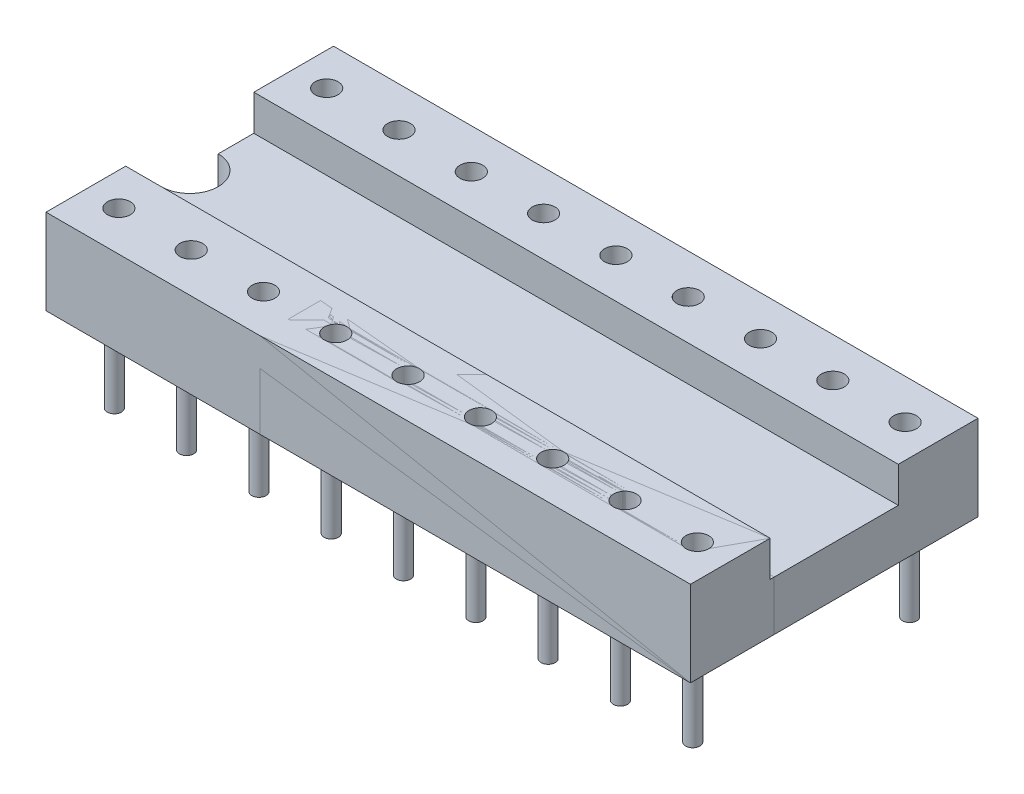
ISO-10303-21;
HEADER;
FILE_DESCRIPTION(('STEP AP214'),'2;1');
FILE_NAME('part.step','',(''),(''),'','','');
FILE_SCHEMA(('AUTOMOTIVE_DESIGN { 1 0 10303 214 1 1 1 1 }'));
ENDSEC;
DATA;
#1=APPLICATION_CONTEXT('core data for automotive mechanical design processes');
#2=APPLICATION_PROTOCOL_DEFINITION('international standard','automotive_design',2000,#1);
#3=PRODUCT_CONTEXT('',#1,'mechanical');
#4=PRODUCT('Part','Part','',(#3));
#5=PRODUCT_RELATED_PRODUCT_CATEGORY('part','',(#4));
#6=PRODUCT_DEFINITION_FORMATION('','',#4);
#7=PRODUCT_DEFINITION_CONTEXT('part definition',#1,'design');
#8=PRODUCT_DEFINITION('design','',#6,#7);
#9=PRODUCT_DEFINITION_SHAPE('','',#8);
#10=(LENGTH_UNIT() NAMED_UNIT(*) SI_UNIT(.MILLI.,.METRE.));
#11=(NAMED_UNIT(*) PLANE_ANGLE_UNIT() SI_UNIT($,.RADIAN.));
#12=(NAMED_UNIT(*) SI_UNIT($,.STERADIAN.) SOLID_ANGLE_UNIT());
#13=UNCERTAINTY_MEASURE_WITH_UNIT(LENGTH_MEASURE(1.E-05),#10,'distance_accuracy_value','');
#14=(GEOMETRIC_REPRESENTATION_CONTEXT(3) GLOBAL_UNCERTAINTY_ASSIGNED_CONTEXT((#13)) GLOBAL_UNIT_ASSIGNED_CONTEXT((#10,
#11,#12)) REPRESENTATION_CONTEXT('',''));
#15=CARTESIAN_POINT('',(0.,0.,0.));
#16=DIRECTION('',(0.,0.,1.));
#17=DIRECTION('',(1.,0.,0.));
#18=AXIS2_PLACEMENT_3D('',#15,#16,#17);
#19=CARTESIAN_POINT('',(22.64,0.,5.05));
#20=DIRECTION('',(0.,1.,0.));
#21=DIRECTION('',(0.,0.,1.));
#22=AXIS2_PLACEMENT_3D('',#19,#20,#21);
#23=PLANE('',#22);
#24=CARTESIAN_POINT('',(21.48,0.,3.81));
#25=DIRECTION('',(0.,1.,0.));
#26=DIRECTION('',(0.,0.,1.));
#27=AXIS2_PLACEMENT_3D('',#24,#25,#26);
#28=CIRCLE('',#27,0.25);
#29=CARTESIAN_POINT('',(21.48,0.,4.06));
#30=VERTEX_POINT('',#29);
#31=EDGE_CURVE('P0_E37',#30,#30,#28,.F.);
#32=ORIENTED_EDGE('',*,*,#31,.F.);
#33=EDGE_LOOP('',(#32));
#34=FACE_BOUND('',#33,.T.);
#35=CARTESIAN_POINT('',(18.94,0.,3.81));
#36=DIRECTION('',(0.,1.,0.));
#37=DIRECTION('',(0.,0.,1.));
#38=AXIS2_PLACEMENT_3D('',#35,#36,#37);
#39=CIRCLE('',#38,0.25);
#40=CARTESIAN_POINT('',(18.94,0.,4.06));
#41=VERTEX_POINT('',#40);
#42=EDGE_CURVE('P0_E124',#41,#41,#39,.F.);
#43=ORIENTED_EDGE('',*,*,#42,.F.);
#44=EDGE_LOOP('',(#43));
#45=FACE_BOUND('',#44,.T.);
#46=CARTESIAN_POINT('',(16.4,0.,3.81));
#47=DIRECTION('',(0.,1.,0.));
#48=DIRECTION('',(0.,0.,1.));
#49=AXIS2_PLACEMENT_3D('',#46,#47,#48);
#50=CIRCLE('',#49,0.25);
#51=CARTESIAN_POINT('',(16.4,0.,4.06));
#52=VERTEX_POINT('',#51);
#53=EDGE_CURVE('P0_E121',#52,#52,#50,.F.);
#54=ORIENTED_EDGE('',*,*,#53,.F.);
#55=EDGE_LOOP('',(#54));
#56=FACE_BOUND('',#55,.T.);
#57=CARTESIAN_POINT('',(13.86,0.,3.81));
#58=DIRECTION('',(0.,1.,0.));
#59=DIRECTION('',(0.,0.,1.));
#60=AXIS2_PLACEMENT_3D('',#57,#58,#59);
#61=CIRCLE('',#60,0.25);
#62=CARTESIAN_POINT('',(13.86,0.,4.06));
#63=VERTEX_POINT('',#62);
#64=EDGE_CURVE('P0_E118',#63,#63,#61,.F.);
#65=ORIENTED_EDGE('',*,*,#64,.F.);
#66=EDGE_LOOP('',(#65));
#67=FACE_BOUND('',#66,.T.);
#68=CARTESIAN_POINT('',(11.32,0.,3.81));
#69=DIRECTION('',(0.,1.,0.));
#70=DIRECTION('',(0.,0.,1.));
#71=AXIS2_PLACEMENT_3D('',#68,#69,#70);
#72=CIRCLE('',#71,0.25);
#73=CARTESIAN_POINT('',(11.32,0.,4.06));
#74=VERTEX_POINT('',#73);
#75=EDGE_CURVE('P0_E115',#74,#74,#72,.F.);
#76=ORIENTED_EDGE('',*,*,#75,.F.);
#77=EDGE_LOOP('',(#76));
#78=FACE_BOUND('',#77,.T.);
#79=CARTESIAN_POINT('',(8.78,0.,3.81));
#80=DIRECTION('',(0.,1.,0.));
#81=DIRECTION('',(0.,0.,1.));
#82=AXIS2_PLACEMENT_3D('',#79,#80,#81);
#83=CIRCLE('',#82,0.25);
#84=CARTESIAN_POINT('',(8.78,0.,4.06));
#85=VERTEX_POINT('',#84);
#86=EDGE_CURVE('P0_E112',#85,#85,#83,.F.);
#87=ORIENTED_EDGE('',*,*,#86,.F.);
#88=EDGE_LOOP('',(#87));
#89=FACE_BOUND('',#88,.T.);
#90=DIRECTION('',(-1.,0.,0.));
#91=VECTOR('',#90,1.);
#92=CARTESIAN_POINT('',(22.64,0.,5.05));
#93=LINE('',#92,#91);
#94=CARTESIAN_POINT('',(22.64,0.,5.05));
#95=VERTEX_POINT('',#94);
#96=CARTESIAN_POINT('',(7.51,0.,5.05));
#97=VERTEX_POINT('',#96);
#98=EDGE_CURVE('P0_E102',#95,#97,#93,.T.);
#99=ORIENTED_EDGE('',*,*,#98,.T.);
#100=DIRECTION('',(0.,0.,-1.));
#101=VECTOR('',#100,1.);
#102=CARTESIAN_POINT('',(7.51,0.,5.05));
#103=LINE('',#102,#101);
#104=CARTESIAN_POINT('',(7.51,0.,2.10994288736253));
#105=VERTEX_POINT('',#104);
#106=EDGE_CURVE('P0_E86',#97,#105,#103,.T.);
#107=ORIENTED_EDGE('',*,*,#106,.T.);
#108=DIRECTION('',(1.,0.,0.));
#109=VECTOR('',#108,1.);
#110=CARTESIAN_POINT('',(22.64,0.,2.10994288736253));
#111=LINE('',#110,#109);
#112=CARTESIAN_POINT('',(22.64,0.,2.10994288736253));
#113=VERTEX_POINT('',#112);
#114=EDGE_CURVE('P0_E146',#105,#113,#111,.T.);
#115=ORIENTED_EDGE('',*,*,#114,.T.);
#116=DIRECTION('',(0.,0.,-1.));
#117=VECTOR('',#116,1.);
#118=CARTESIAN_POINT('',(22.64,0.,5.05));
#119=LINE('',#118,#117);
#120=EDGE_CURVE('P0_E106',#95,#113,#119,.T.);
#121=ORIENTED_EDGE('',*,*,#120,.F.);
#122=EDGE_LOOP('',(#99,#107,#115,#121));
#123=FACE_BOUND('',#122,.T.);
#124=ADVANCED_FACE('P0_F29',(#34,#45,#56,#67,#78,#89,#123),#23,.F.);
#125=CARTESIAN_POINT('',(22.64,1.75,-2.25));
#126=DIRECTION('',(0.,-1.,0.));
#127=DIRECTION('',(0.,0.,-1.));
#128=AXIS2_PLACEMENT_3D('',#125,#126,#127);
#129=PLANE('',#128);
#130=DIRECTION('',(-1.,0.,0.));
#131=VECTOR('',#130,1.);
#132=CARTESIAN_POINT('',(22.64,1.75,2.10994288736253));
#133=LINE('',#132,#131);
#134=CARTESIAN_POINT('',(22.64,1.75,2.10994288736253));
#135=VERTEX_POINT('',#134);
#136=CARTESIAN_POINT('',(7.51,1.75,2.10994288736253));
#137=VERTEX_POINT('',#136);
#138=EDGE_CURVE('P0_E214',#135,#137,#133,.T.);
#139=ORIENTED_EDGE('',*,*,#138,.T.);
#140=DIRECTION('',(0.,0.,1.));
#141=VECTOR('',#140,1.);
#142=CARTESIAN_POINT('',(7.51,1.75,-2.25));
#143=LINE('',#142,#141);
#144=CARTESIAN_POINT('',(7.51,1.75,2.25));
#145=VERTEX_POINT('',#144);
#146=EDGE_CURVE('P0_E44',#137,#145,#143,.T.);
#147=ORIENTED_EDGE('',*,*,#146,.T.);
#148=DIRECTION('',(-1.,0.,0.));
#149=VECTOR('',#148,1.);
#150=CARTESIAN_POINT('',(22.64,1.75,2.25));
#151=LINE('',#150,#149);
#152=CARTESIAN_POINT('',(22.64,1.75,2.25));
#153=VERTEX_POINT('',#152);
#154=EDGE_CURVE('P0_E104',#153,#145,#151,.T.);
#155=ORIENTED_EDGE('',*,*,#154,.F.);
#156=DIRECTION('',(0.,0.,1.));
#157=VECTOR('',#156,1.);
#158=CARTESIAN_POINT('',(22.64,1.75,-2.25));
#159=LINE('',#158,#157);
#160=EDGE_CURVE('P0_E155',#135,#153,#159,.T.);
#161=ORIENTED_EDGE('',*,*,#160,.F.);
#162=EDGE_LOOP('',(#139,#147,#155,#161));
#163=FACE_BOUND('',#162,.T.);
#164=ADVANCED_FACE('P0_F31',(#163),#129,.F.);
#165=CARTESIAN_POINT('',(22.64,1.75,2.25));
#166=DIRECTION('',(0.,0.,1.));
#167=DIRECTION('',(0.,-1.,0.));
#168=AXIS2_PLACEMENT_3D('',#165,#166,#167);
#169=PLANE('',#168);
#170=ORIENTED_EDGE('',*,*,#154,.T.);
#171=DIRECTION('',(0.,1.,0.));
#172=VECTOR('',#171,1.);
#173=CARTESIAN_POINT('',(7.51,1.75,2.25));
#174=LINE('',#173,#172);
#175=CARTESIAN_POINT('',(7.51,3.,2.25));
#176=VERTEX_POINT('',#175);
#177=EDGE_CURVE('P0_E90',#145,#176,#174,.T.);
#178=ORIENTED_EDGE('',*,*,#177,.T.);
#179=DIRECTION('',(-1.,0.,0.));
#180=VECTOR('',#179,1.);
#181=CARTESIAN_POINT('',(22.64,3.,2.25));
#182=LINE('',#181,#180);
#183=CARTESIAN_POINT('',(22.64,3.,2.25));
#184=VERTEX_POINT('',#183);
#185=EDGE_CURVE('P0_E99',#184,#176,#182,.T.);
#186=ORIENTED_EDGE('',*,*,#185,.F.);
#187=DIRECTION('',(0.,1.,0.));
#188=VECTOR('',#187,1.);
#189=CARTESIAN_POINT('',(22.64,1.75,2.25));
#190=LINE('',#189,#188);
#191=EDGE_CURVE('P0_E153',#153,#184,#190,.T.);
#192=ORIENTED_EDGE('',*,*,#191,.F.);
#193=EDGE_LOOP('',(#170,#178,#186,#192));
#194=FACE_BOUND('',#193,.T.);
#195=ADVANCED_FACE('P0_F224',(#194),#169,.F.);
#196=CARTESIAN_POINT('',(22.64,3.,2.25));
#197=DIRECTION('',(0.,-1.,0.));
#198=DIRECTION('',(0.,0.,-1.));
#199=AXIS2_PLACEMENT_3D('',#196,#197,#198);
#200=PLANE('',#199);
#201=CARTESIAN_POINT('',(21.48,3.,3.64999999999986));
#202=DIRECTION('',(0.,1.,0.));
#203=DIRECTION('',(0.,0.,1.));
#204=AXIS2_PLACEMENT_3D('',#201,#202,#203);
#205=CIRCLE('',#204,0.4);
#206=CARTESIAN_POINT('',(21.48,3.,4.04999999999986));
#207=VERTEX_POINT('',#206);
#208=EDGE_CURVE('P0_E190',#207,#207,#205,.T.);
#209=ORIENTED_EDGE('',*,*,#208,.F.);
#210=EDGE_LOOP('',(#209));
#211=FACE_BOUND('',#210,.T.);
#212=CARTESIAN_POINT('',(18.94,3.,3.64999999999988));
#213=DIRECTION('',(0.,1.,0.));
#214=DIRECTION('',(0.,0.,1.));
#215=AXIS2_PLACEMENT_3D('',#212,#213,#214);
#216=CIRCLE('',#215,0.4);
#217=CARTESIAN_POINT('',(18.94,3.,4.04999999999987));
#218=VERTEX_POINT('',#217);
#219=EDGE_CURVE('P0_E184',#218,#218,#216,.T.);
#220=ORIENTED_EDGE('',*,*,#219,.F.);
#221=EDGE_LOOP('',(#220));
#222=FACE_BOUND('',#221,.T.);
#223=CARTESIAN_POINT('',(16.4,3.,3.6499999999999));
#224=DIRECTION('',(0.,1.,0.));
#225=DIRECTION('',(0.,0.,1.));
#226=AXIS2_PLACEMENT_3D('',#223,#224,#225);
#227=CIRCLE('',#226,0.4);
#228=CARTESIAN_POINT('',(16.4,3.,4.0499999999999));
#229=VERTEX_POINT('',#228);
#230=EDGE_CURVE('P0_E178',#229,#229,#227,.T.);
#231=ORIENTED_EDGE('',*,*,#230,.F.);
#232=EDGE_LOOP('',(#231));
#233=FACE_BOUND('',#232,.T.);
#234=CARTESIAN_POINT('',(13.86,3.,3.64999999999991));
#235=DIRECTION('',(0.,1.,0.));
#236=DIRECTION('',(0.,0.,1.));
#237=AXIS2_PLACEMENT_3D('',#234,#235,#236);
#238=CIRCLE('',#237,0.4);
#239=CARTESIAN_POINT('',(13.86,3.,4.04999999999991));
#240=VERTEX_POINT('',#239);
#241=EDGE_CURVE('P0_E172',#240,#240,#238,.T.);
#242=ORIENTED_EDGE('',*,*,#241,.F.);
#243=EDGE_LOOP('',(#242));
#244=FACE_BOUND('',#243,.T.);
#245=CARTESIAN_POINT('',(11.32,3.,3.64999999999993));
#246=DIRECTION('',(0.,1.,0.));
#247=DIRECTION('',(0.,0.,1.));
#248=AXIS2_PLACEMENT_3D('',#245,#246,#247);
#249=CIRCLE('',#248,0.4);
#250=CARTESIAN_POINT('',(11.32,3.,4.04999999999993));
#251=VERTEX_POINT('',#250);
#252=EDGE_CURVE('P0_E166',#251,#251,#249,.T.);
#253=ORIENTED_EDGE('',*,*,#252,.F.);
#254=EDGE_LOOP('',(#253));
#255=FACE_BOUND('',#254,.T.);
#256=CARTESIAN_POINT('',(8.78,3.,3.64999999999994));
#257=DIRECTION('',(0.,1.,0.));
#258=DIRECTION('',(0.,0.,1.));
#259=AXIS2_PLACEMENT_3D('',#256,#257,#258);
#260=CIRCLE('',#259,0.4);
#261=CARTESIAN_POINT('',(8.78,3.,4.04999999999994));
#262=VERTEX_POINT('',#261);
#263=EDGE_CURVE('P0_E160',#262,#262,#260,.T.);
#264=ORIENTED_EDGE('',*,*,#263,.F.);
#265=EDGE_LOOP('',(#264));
#266=FACE_BOUND('',#265,.T.);
#267=ORIENTED_EDGE('',*,*,#185,.T.);
#268=DIRECTION('',(0.,0.,-1.));
#269=VECTOR('',#268,1.);
#270=CARTESIAN_POINT('',(7.51,3.,6.63676062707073));
#271=LINE('',#270,#269);
#272=CARTESIAN_POINT('',(7.51,3.,5.05));
#273=VERTEX_POINT('',#272);
#274=EDGE_CURVE('P0_E83',#273,#176,#271,.T.);
#275=ORIENTED_EDGE('',*,*,#274,.F.);
#276=DIRECTION('',(-1.,0.,0.));
#277=VECTOR('',#276,1.);
#278=CARTESIAN_POINT('',(22.64,3.,5.05));
#279=LINE('',#278,#277);
#280=CARTESIAN_POINT('',(22.64,3.,5.05));
#281=VERTEX_POINT('',#280);
#282=EDGE_CURVE('P0_E97',#281,#273,#279,.T.);
#283=ORIENTED_EDGE('',*,*,#282,.F.);
#284=DIRECTION('',(0.,0.,1.));
#285=VECTOR('',#284,1.);
#286=CARTESIAN_POINT('',(22.64,3.,2.25));
#287=LINE('',#286,#285);
#288=EDGE_CURVE('P0_E149',#184,#281,#287,.T.);
#289=ORIENTED_EDGE('',*,*,#288,.F.);
#290=EDGE_LOOP('',(#267,#275,#283,#289));
#291=FACE_BOUND('',#290,.T.);
#292=ADVANCED_FACE('P0_F95',(#211,#222,#233,#244,#255,#266,#291),#200,.F.);
#293=CARTESIAN_POINT('',(22.64,3.,5.05));
#294=DIRECTION('',(0.,0.,-1.));
#295=DIRECTION('',(-1.,0.,0.));
#296=AXIS2_PLACEMENT_3D('',#293,#294,#295);
#297=PLANE('',#296);
#298=ORIENTED_EDGE('',*,*,#282,.T.);
#299=DIRECTION('',(0.,-1.,0.));
#300=VECTOR('',#299,1.);
#301=CARTESIAN_POINT('',(7.51,3.,5.05));
#302=LINE('',#301,#300);
#303=EDGE_CURVE('P0_E80',#273,#97,#302,.T.);
#304=ORIENTED_EDGE('',*,*,#303,.T.);
#305=ORIENTED_EDGE('',*,*,#98,.F.);
#306=DIRECTION('',(0.,-1.,0.));
#307=VECTOR('',#306,1.);
#308=CARTESIAN_POINT('',(22.64,3.,5.05));
#309=LINE('',#308,#307);
#310=EDGE_CURVE('P0_E51',#281,#95,#309,.T.);
#311=ORIENTED_EDGE('',*,*,#310,.F.);
#312=EDGE_LOOP('',(#298,#304,#305,#311));
#313=FACE_BOUND('',#312,.T.);
#314=ADVANCED_FACE('P0_F101',(#313),#297,.F.);
#315=CARTESIAN_POINT('',(22.64,1.75,5.05));
#316=DIRECTION('',(1.,0.,0.));
#317=DIRECTION('',(0.,0.,-1.));
#318=AXIS2_PLACEMENT_3D('',#315,#316,#317);
#319=PLANE('',#318);
#320=DIRECTION('',(0.,-1.,0.));
#321=VECTOR('',#320,1.);
#322=CARTESIAN_POINT('',(22.64,1.75,2.10994288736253));
#323=LINE('',#322,#321);
#324=EDGE_CURVE('P0_E211',#135,#113,#323,.T.);
#325=ORIENTED_EDGE('',*,*,#324,.F.);
#326=ORIENTED_EDGE('',*,*,#160,.T.);
#327=ORIENTED_EDGE('',*,*,#191,.T.);
#328=ORIENTED_EDGE('',*,*,#288,.T.);
#329=ORIENTED_EDGE('',*,*,#310,.T.);
#330=ORIENTED_EDGE('',*,*,#120,.T.);
#331=EDGE_LOOP('',(#325,#326,#327,#328,#329,#330));
#332=FACE_BOUND('',#331,.T.);
#333=ADVANCED_FACE('P0_F225',(#332),#319,.T.);
#334=CARTESIAN_POINT('',(8.78,0.5,3.64999999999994));
#335=DIRECTION('',(0.,1.,0.));
#336=DIRECTION('',(0.,0.,1.));
#337=AXIS2_PLACEMENT_3D('',#334,#335,#336);
#338=CYLINDRICAL_SURFACE('',#337,0.4);
#339=CARTESIAN_POINT('',(8.78,0.5,3.64999999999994));
#340=DIRECTION('',(0.,1.,0.));
#341=DIRECTION('',(0.,0.,1.));
#342=AXIS2_PLACEMENT_3D('',#339,#340,#341);
#343=CIRCLE('',#342,0.4);
#344=CARTESIAN_POINT('',(8.78,0.5,4.04999999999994));
#345=VERTEX_POINT('',#344);
#346=EDGE_CURVE('P0_E157',#345,#345,#343,.T.);
#347=ORIENTED_EDGE('',*,*,#346,.F.);
#348=EDGE_LOOP('',(#347));
#349=FACE_BOUND('',#348,.T.);
#350=ORIENTED_EDGE('',*,*,#263,.T.);
#351=EDGE_LOOP('',(#350));
#352=FACE_BOUND('',#351,.T.);
#353=ADVANCED_FACE('P0_F326',(#349,#352),#338,.F.);
#354=CARTESIAN_POINT('',(8.78,0.5,3.64999999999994));
#355=DIRECTION('',(0.,1.,0.));
#356=DIRECTION('',(0.,0.,1.));
#357=AXIS2_PLACEMENT_3D('',#354,#355,#356);
#358=PLANE('',#357);
#359=ORIENTED_EDGE('',*,*,#346,.T.);
#360=EDGE_LOOP('',(#359));
#361=FACE_BOUND('',#360,.T.);
#362=ADVANCED_FACE('P0_F322',(#361),#358,.T.);
#363=CARTESIAN_POINT('',(11.32,0.5,3.64999999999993));
#364=DIRECTION('',(0.,1.,0.));
#365=DIRECTION('',(0.,0.,1.));
#366=AXIS2_PLACEMENT_3D('',#363,#364,#365);
#367=CYLINDRICAL_SURFACE('',#366,0.4);
#368=CARTESIAN_POINT('',(11.32,0.5,3.64999999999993));
#369=DIRECTION('',(0.,1.,0.));
#370=DIRECTION('',(0.,0.,1.));
#371=AXIS2_PLACEMENT_3D('',#368,#369,#370);
#372=CIRCLE('',#371,0.4);
#373=CARTESIAN_POINT('',(11.32,0.5,4.04999999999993));
#374=VERTEX_POINT('',#373);
#375=EDGE_CURVE('P0_E163',#374,#374,#372,.T.);
#376=ORIENTED_EDGE('',*,*,#375,.F.);
#377=EDGE_LOOP('',(#376));
#378=FACE_BOUND('',#377,.T.);
#379=ORIENTED_EDGE('',*,*,#252,.T.);
#380=EDGE_LOOP('',(#379));
#381=FACE_BOUND('',#380,.T.);
#382=ADVANCED_FACE('P0_F318',(#378,#381),#367,.F.);
#383=CARTESIAN_POINT('',(11.32,0.5,3.64999999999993));
#384=DIRECTION('',(0.,1.,0.));
#385=DIRECTION('',(0.,0.,1.));
#386=AXIS2_PLACEMENT_3D('',#383,#384,#385);
#387=PLANE('',#386);
#388=ORIENTED_EDGE('',*,*,#375,.T.);
#389=EDGE_LOOP('',(#388));
#390=FACE_BOUND('',#389,.T.);
#391=ADVANCED_FACE('P0_F314',(#390),#387,.T.);
#392=CARTESIAN_POINT('',(13.86,0.5,3.64999999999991));
#393=DIRECTION('',(0.,1.,0.));
#394=DIRECTION('',(0.,0.,1.));
#395=AXIS2_PLACEMENT_3D('',#392,#393,#394);
#396=CYLINDRICAL_SURFACE('',#395,0.4);
#397=CARTESIAN_POINT('',(13.86,0.5,3.64999999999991));
#398=DIRECTION('',(0.,1.,0.));
#399=DIRECTION('',(0.,0.,1.));
#400=AXIS2_PLACEMENT_3D('',#397,#398,#399);
#401=CIRCLE('',#400,0.4);
#402=CARTESIAN_POINT('',(13.86,0.5,4.04999999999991));
#403=VERTEX_POINT('',#402);
#404=EDGE_CURVE('P0_E169',#403,#403,#401,.T.);
#405=ORIENTED_EDGE('',*,*,#404,.F.);
#406=EDGE_LOOP('',(#405));
#407=FACE_BOUND('',#406,.T.);
#408=ORIENTED_EDGE('',*,*,#241,.T.);
#409=EDGE_LOOP('',(#408));
#410=FACE_BOUND('',#409,.T.);
#411=ADVANCED_FACE('P0_F310',(#407,#410),#396,.F.);
#412=CARTESIAN_POINT('',(13.86,0.5,3.64999999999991));
#413=DIRECTION('',(0.,1.,0.));
#414=DIRECTION('',(0.,0.,1.));
#415=AXIS2_PLACEMENT_3D('',#412,#413,#414);
#416=PLANE('',#415);
#417=ORIENTED_EDGE('',*,*,#404,.T.);
#418=EDGE_LOOP('',(#417));
#419=FACE_BOUND('',#418,.T.);
#420=ADVANCED_FACE('P0_F306',(#419),#416,.T.);
#421=CARTESIAN_POINT('',(16.4,0.5,3.6499999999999));
#422=DIRECTION('',(0.,1.,0.));
#423=DIRECTION('',(0.,0.,1.));
#424=AXIS2_PLACEMENT_3D('',#421,#422,#423);
#425=CYLINDRICAL_SURFACE('',#424,0.4);
#426=CARTESIAN_POINT('',(16.4,0.5,3.6499999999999));
#427=DIRECTION('',(0.,1.,0.));
#428=DIRECTION('',(0.,0.,1.));
#429=AXIS2_PLACEMENT_3D('',#426,#427,#428);
#430=CIRCLE('',#429,0.4);
#431=CARTESIAN_POINT('',(16.4,0.5,4.0499999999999));
#432=VERTEX_POINT('',#431);
#433=EDGE_CURVE('P0_E175',#432,#432,#430,.T.);
#434=ORIENTED_EDGE('',*,*,#433,.F.);
#435=EDGE_LOOP('',(#434));
#436=FACE_BOUND('',#435,.T.);
#437=ORIENTED_EDGE('',*,*,#230,.T.);
#438=EDGE_LOOP('',(#437));
#439=FACE_BOUND('',#438,.T.);
#440=ADVANCED_FACE('P0_F302',(#436,#439),#425,.F.);
#441=CARTESIAN_POINT('',(16.4,0.5,3.6499999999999));
#442=DIRECTION('',(0.,1.,0.));
#443=DIRECTION('',(0.,0.,1.));
#444=AXIS2_PLACEMENT_3D('',#441,#442,#443);
#445=PLANE('',#444);
#446=ORIENTED_EDGE('',*,*,#433,.T.);
#447=EDGE_LOOP('',(#446));
#448=FACE_BOUND('',#447,.T.);
#449=ADVANCED_FACE('P0_F298',(#448),#445,.T.);
#450=CARTESIAN_POINT('',(18.94,0.5,3.64999999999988));
#451=DIRECTION('',(0.,1.,0.));
#452=DIRECTION('',(0.,0.,1.));
#453=AXIS2_PLACEMENT_3D('',#450,#451,#452);
#454=CYLINDRICAL_SURFACE('',#453,0.4);
#455=CARTESIAN_POINT('',(18.94,0.5,3.64999999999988));
#456=DIRECTION('',(0.,1.,0.));
#457=DIRECTION('',(0.,0.,1.));
#458=AXIS2_PLACEMENT_3D('',#455,#456,#457);
#459=CIRCLE('',#458,0.4);
#460=CARTESIAN_POINT('',(18.94,0.5,4.04999999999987));
#461=VERTEX_POINT('',#460);
#462=EDGE_CURVE('P0_E181',#461,#461,#459,.T.);
#463=ORIENTED_EDGE('',*,*,#462,.F.);
#464=EDGE_LOOP('',(#463));
#465=FACE_BOUND('',#464,.T.);
#466=ORIENTED_EDGE('',*,*,#219,.T.);
#467=EDGE_LOOP('',(#466));
#468=FACE_BOUND('',#467,.T.);
#469=ADVANCED_FACE('P0_F294',(#465,#468),#454,.F.);
#470=CARTESIAN_POINT('',(18.94,0.5,3.64999999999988));
#471=DIRECTION('',(0.,1.,0.));
#472=DIRECTION('',(0.,0.,1.));
#473=AXIS2_PLACEMENT_3D('',#470,#471,#472);
#474=PLANE('',#473);
#475=ORIENTED_EDGE('',*,*,#462,.T.);
#476=EDGE_LOOP('',(#475));
#477=FACE_BOUND('',#476,.T.);
#478=ADVANCED_FACE('P0_F290',(#477),#474,.T.);
#479=CARTESIAN_POINT('',(21.48,0.5,3.64999999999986));
#480=DIRECTION('',(0.,1.,0.));
#481=DIRECTION('',(0.,0.,1.));
#482=AXIS2_PLACEMENT_3D('',#479,#480,#481);
#483=CYLINDRICAL_SURFACE('',#482,0.4);
#484=CARTESIAN_POINT('',(21.48,0.5,3.64999999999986));
#485=DIRECTION('',(0.,1.,0.));
#486=DIRECTION('',(0.,0.,1.));
#487=AXIS2_PLACEMENT_3D('',#484,#485,#486);
#488=CIRCLE('',#487,0.4);
#489=CARTESIAN_POINT('',(21.48,0.5,4.04999999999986));
#490=VERTEX_POINT('',#489);
#491=EDGE_CURVE('P0_E187',#490,#490,#488,.T.);
#492=ORIENTED_EDGE('',*,*,#491,.F.);
#493=EDGE_LOOP('',(#492));
#494=FACE_BOUND('',#493,.T.);
#495=ORIENTED_EDGE('',*,*,#208,.T.);
#496=EDGE_LOOP('',(#495));
#497=FACE_BOUND('',#496,.T.);
#498=ADVANCED_FACE('P0_F286',(#494,#497),#483,.F.);
#499=CARTESIAN_POINT('',(21.48,0.5,3.64999999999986));
#500=DIRECTION('',(0.,1.,0.));
#501=DIRECTION('',(0.,0.,1.));
#502=AXIS2_PLACEMENT_3D('',#499,#500,#501);
#503=PLANE('',#502);
#504=ORIENTED_EDGE('',*,*,#491,.T.);
#505=EDGE_LOOP('',(#504));
#506=FACE_BOUND('',#505,.T.);
#507=ADVANCED_FACE('P0_F282',(#506),#503,.T.);
#508=CARTESIAN_POINT('',(8.78,-3.,3.81));
#509=DIRECTION('',(0.,1.,0.));
#510=DIRECTION('',(0.,0.,1.));
#511=AXIS2_PLACEMENT_3D('',#508,#509,#510);
#512=CYLINDRICAL_SURFACE('',#511,0.25);
#513=CARTESIAN_POINT('',(8.78,-3.,3.81));
#514=DIRECTION('',(0.,-1.,0.));
#515=DIRECTION('',(0.,0.,-1.));
#516=AXIS2_PLACEMENT_3D('',#513,#514,#515);
#517=CIRCLE('',#516,0.25);
#518=CARTESIAN_POINT('',(8.78,-3.,3.56));
#519=VERTEX_POINT('',#518);
#520=EDGE_CURVE('P0_E193',#519,#519,#517,.T.);
#521=ORIENTED_EDGE('',*,*,#520,.F.);
#522=EDGE_LOOP('',(#521));
#523=FACE_BOUND('',#522,.T.);
#524=ORIENTED_EDGE('',*,*,#86,.T.);
#525=EDGE_LOOP('',(#524));
#526=FACE_BOUND('',#525,.T.);
#527=ADVANCED_FACE('P0_F278',(#523,#526),#512,.T.);
#528=CARTESIAN_POINT('',(8.78,-3.,3.81));
#529=DIRECTION('',(0.,-1.,0.));
#530=DIRECTION('',(0.,0.,-1.));
#531=AXIS2_PLACEMENT_3D('',#528,#529,#530);
#532=PLANE('',#531);
#533=ORIENTED_EDGE('',*,*,#520,.T.);
#534=EDGE_LOOP('',(#533));
#535=FACE_BOUND('',#534,.T.);
#536=ADVANCED_FACE('P0_F274',(#535),#532,.T.);
#537=CARTESIAN_POINT('',(11.32,-3.,3.81));
#538=DIRECTION('',(0.,1.,0.));
#539=DIRECTION('',(0.,0.,1.));
#540=AXIS2_PLACEMENT_3D('',#537,#538,#539);
#541=CYLINDRICAL_SURFACE('',#540,0.25);
#542=CARTESIAN_POINT('',(11.32,-3.,3.81));
#543=DIRECTION('',(0.,-1.,0.));
#544=DIRECTION('',(0.,0.,-1.));
#545=AXIS2_PLACEMENT_3D('',#542,#543,#544);
#546=CIRCLE('',#545,0.25);
#547=CARTESIAN_POINT('',(11.32,-3.,3.56));
#548=VERTEX_POINT('',#547);
#549=EDGE_CURVE('P0_E196',#548,#548,#546,.T.);
#550=ORIENTED_EDGE('',*,*,#549,.F.);
#551=EDGE_LOOP('',(#550));
#552=FACE_BOUND('',#551,.T.);
#553=ORIENTED_EDGE('',*,*,#75,.T.);
#554=EDGE_LOOP('',(#553));
#555=FACE_BOUND('',#554,.T.);
#556=ADVANCED_FACE('P0_F270',(#552,#555),#541,.T.);
#557=CARTESIAN_POINT('',(11.32,-3.,3.81));
#558=DIRECTION('',(0.,-1.,0.));
#559=DIRECTION('',(0.,0.,-1.));
#560=AXIS2_PLACEMENT_3D('',#557,#558,#559);
#561=PLANE('',#560);
#562=ORIENTED_EDGE('',*,*,#549,.T.);
#563=EDGE_LOOP('',(#562));
#564=FACE_BOUND('',#563,.T.);
#565=ADVANCED_FACE('P0_F266',(#564),#561,.T.);
#566=CARTESIAN_POINT('',(13.86,-3.,3.81));
#567=DIRECTION('',(0.,1.,0.));
#568=DIRECTION('',(0.,0.,1.));
#569=AXIS2_PLACEMENT_3D('',#566,#567,#568);
#570=CYLINDRICAL_SURFACE('',#569,0.25);
#571=CARTESIAN_POINT('',(13.86,-3.,3.81));
#572=DIRECTION('',(0.,-1.,0.));
#573=DIRECTION('',(0.,0.,-1.));
#574=AXIS2_PLACEMENT_3D('',#571,#572,#573);
#575=CIRCLE('',#574,0.25);
#576=CARTESIAN_POINT('',(13.86,-3.,3.56));
#577=VERTEX_POINT('',#576);
#578=EDGE_CURVE('P0_E199',#577,#577,#575,.T.);
#579=ORIENTED_EDGE('',*,*,#578,.F.);
#580=EDGE_LOOP('',(#579));
#581=FACE_BOUND('',#580,.T.);
#582=ORIENTED_EDGE('',*,*,#64,.T.);
#583=EDGE_LOOP('',(#582));
#584=FACE_BOUND('',#583,.T.);
#585=ADVANCED_FACE('P0_F262',(#581,#584),#570,.T.);
#586=CARTESIAN_POINT('',(13.86,-3.,3.81));
#587=DIRECTION('',(0.,-1.,0.));
#588=DIRECTION('',(0.,0.,-1.));
#589=AXIS2_PLACEMENT_3D('',#586,#587,#588);
#590=PLANE('',#589);
#591=ORIENTED_EDGE('',*,*,#578,.T.);
#592=EDGE_LOOP('',(#591));
#593=FACE_BOUND('',#592,.T.);
#594=ADVANCED_FACE('P0_F258',(#593),#590,.T.);
#595=CARTESIAN_POINT('',(16.4,-3.,3.81));
#596=DIRECTION('',(0.,1.,0.));
#597=DIRECTION('',(0.,0.,1.));
#598=AXIS2_PLACEMENT_3D('',#595,#596,#597);
#599=CYLINDRICAL_SURFACE('',#598,0.25);
#600=CARTESIAN_POINT('',(16.4,-3.,3.81));
#601=DIRECTION('',(0.,-1.,0.));
#602=DIRECTION('',(0.,0.,-1.));
#603=AXIS2_PLACEMENT_3D('',#600,#601,#602);
#604=CIRCLE('',#603,0.25);
#605=CARTESIAN_POINT('',(16.4,-3.,3.56));
#606=VERTEX_POINT('',#605);
#607=EDGE_CURVE('P0_E202',#606,#606,#604,.T.);
#608=ORIENTED_EDGE('',*,*,#607,.F.);
#609=EDGE_LOOP('',(#608));
#610=FACE_BOUND('',#609,.T.);
#611=ORIENTED_EDGE('',*,*,#53,.T.);
#612=EDGE_LOOP('',(#611));
#613=FACE_BOUND('',#612,.T.);
#614=ADVANCED_FACE('P0_F254',(#610,#613),#599,.T.);
#615=CARTESIAN_POINT('',(16.4,-3.,3.81));
#616=DIRECTION('',(0.,-1.,0.));
#617=DIRECTION('',(0.,0.,-1.));
#618=AXIS2_PLACEMENT_3D('',#615,#616,#617);
#619=PLANE('',#618);
#620=ORIENTED_EDGE('',*,*,#607,.T.);
#621=EDGE_LOOP('',(#620));
#622=FACE_BOUND('',#621,.T.);
#623=ADVANCED_FACE('P0_F250',(#622),#619,.T.);
#624=CARTESIAN_POINT('',(18.94,-3.,3.81));
#625=DIRECTION('',(0.,1.,0.));
#626=DIRECTION('',(0.,0.,1.));
#627=AXIS2_PLACEMENT_3D('',#624,#625,#626);
#628=CYLINDRICAL_SURFACE('',#627,0.25);
#629=CARTESIAN_POINT('',(18.94,-3.,3.81));
#630=DIRECTION('',(0.,-1.,0.));
#631=DIRECTION('',(0.,0.,-1.));
#632=AXIS2_PLACEMENT_3D('',#629,#630,#631);
#633=CIRCLE('',#632,0.25);
#634=CARTESIAN_POINT('',(18.94,-3.,3.56));
#635=VERTEX_POINT('',#634);
#636=EDGE_CURVE('P0_E205',#635,#635,#633,.T.);
#637=ORIENTED_EDGE('',*,*,#636,.F.);
#638=EDGE_LOOP('',(#637));
#639=FACE_BOUND('',#638,.T.);
#640=ORIENTED_EDGE('',*,*,#42,.T.);
#641=EDGE_LOOP('',(#640));
#642=FACE_BOUND('',#641,.T.);
#643=ADVANCED_FACE('P0_F246',(#639,#642),#628,.T.);
#644=CARTESIAN_POINT('',(18.94,-3.,3.81));
#645=DIRECTION('',(0.,-1.,0.));
#646=DIRECTION('',(0.,0.,-1.));
#647=AXIS2_PLACEMENT_3D('',#644,#645,#646);
#648=PLANE('',#647);
#649=ORIENTED_EDGE('',*,*,#636,.T.);
#650=EDGE_LOOP('',(#649));
#651=FACE_BOUND('',#650,.T.);
#652=ADVANCED_FACE('P0_F242',(#651),#648,.T.);
#653=CARTESIAN_POINT('',(21.48,-3.,3.81));
#654=DIRECTION('',(0.,1.,0.));
#655=DIRECTION('',(0.,0.,1.));
#656=AXIS2_PLACEMENT_3D('',#653,#654,#655);
#657=CYLINDRICAL_SURFACE('',#656,0.25);
#658=CARTESIAN_POINT('',(21.48,-3.,3.81));
#659=DIRECTION('',(0.,-1.,0.));
#660=DIRECTION('',(0.,0.,-1.));
#661=AXIS2_PLACEMENT_3D('',#658,#659,#660);
#662=CIRCLE('',#661,0.25);
#663=CARTESIAN_POINT('',(21.48,-3.,3.56));
#664=VERTEX_POINT('',#663);
#665=EDGE_CURVE('P0_E208',#664,#664,#662,.T.);
#666=ORIENTED_EDGE('',*,*,#665,.F.);
#667=EDGE_LOOP('',(#666));
#668=FACE_BOUND('',#667,.T.);
#669=ORIENTED_EDGE('',*,*,#31,.T.);
#670=EDGE_LOOP('',(#669));
#671=FACE_BOUND('',#670,.T.);
#672=ADVANCED_FACE('P0_F129',(#668,#671),#657,.T.);
#673=CARTESIAN_POINT('',(21.48,-3.,3.81));
#674=DIRECTION('',(0.,-1.,0.));
#675=DIRECTION('',(0.,0.,-1.));
#676=AXIS2_PLACEMENT_3D('',#673,#674,#675);
#677=PLANE('',#676);
#678=ORIENTED_EDGE('',*,*,#665,.T.);
#679=EDGE_LOOP('',(#678));
#680=FACE_BOUND('',#679,.T.);
#681=ADVANCED_FACE('P0_F229',(#680),#677,.T.);
#682=CARTESIAN_POINT('',(23.6516887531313,-3.,2.10994288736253));
#683=DIRECTION('',(0.,0.,1.));
#684=DIRECTION('',(1.,0.,0.));
#685=AXIS2_PLACEMENT_3D('',#682,#683,#684);
#686=PLANE('',#685);
#687=ORIENTED_EDGE('',*,*,#114,.F.);
#688=DIRECTION('',(0.,1.,0.));
#689=VECTOR('',#688,1.);
#690=CARTESIAN_POINT('',(7.51,-3.,2.10994288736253));
#691=LINE('',#690,#689);
#692=EDGE_CURVE('P0_E11',#105,#137,#691,.T.);
#693=ORIENTED_EDGE('',*,*,#692,.T.);
#694=ORIENTED_EDGE('',*,*,#138,.F.);
#695=ORIENTED_EDGE('',*,*,#324,.T.);
#696=EDGE_LOOP('',(#687,#693,#694,#695));
#697=FACE_BOUND('',#696,.T.);
#698=ADVANCED_FACE('P0_F227',(#697),#686,.F.);
#699=CARTESIAN_POINT('',(7.51,-3.,6.63676062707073));
#700=DIRECTION('',(1.,0.,0.));
#701=DIRECTION('',(0.,0.,-1.));
#702=AXIS2_PLACEMENT_3D('',#699,#700,#701);
#703=PLANE('',#702);
#704=ORIENTED_EDGE('',*,*,#146,.F.);
#705=ORIENTED_EDGE('',*,*,#692,.F.);
#706=ORIENTED_EDGE('',*,*,#106,.F.);
#707=ORIENTED_EDGE('',*,*,#303,.F.);
#708=ORIENTED_EDGE('',*,*,#274,.T.);
#709=ORIENTED_EDGE('',*,*,#177,.F.);
#710=EDGE_LOOP('',(#704,#705,#706,#707,#708,#709));
#711=FACE_BOUND('',#710,.T.);
#712=ADVANCED_FACE('P0_F82',(#711),#703,.F.);
#713=CLOSED_SHELL('',(#124,#164,#195,#292,#314,#333,#353,#362,#382,#391,#411,#420,#440,#449,
#469,#478,#498,#507,#527,#536,#556,#565,#585,#594,#614,#623,#643,#652,#672,#681,#698,#712));
#714=MANIFOLD_SOLID_BREP('P0_B2',#713);
#715=CARTESIAN_POINT('',(22.64,0.,5.05));
#716=DIRECTION('',(0.,1.,0.));
#717=DIRECTION('',(0.,0.,1.));
#718=AXIS2_PLACEMENT_3D('',#715,#716,#717);
#719=PLANE('',#718);
#720=CARTESIAN_POINT('',(21.48,0.,3.81));
#721=DIRECTION('',(0.,1.,0.));
#722=DIRECTION('',(0.,0.,1.));
#723=AXIS2_PLACEMENT_3D('',#720,#721,#722);
#724=CIRCLE('',#723,0.25);
#725=CARTESIAN_POINT('',(21.48,0.,4.06));
#726=VERTEX_POINT('',#725);
#727=EDGE_CURVE('P1_E24',#726,#726,#724,.F.);
#728=ORIENTED_EDGE('',*,*,#727,.F.);
#729=EDGE_LOOP('',(#728));
#730=FACE_BOUND('',#729,.T.);
#731=CARTESIAN_POINT('',(18.94,0.,3.81));
#732=DIRECTION('',(0.,1.,0.));
#733=DIRECTION('',(0.,0.,1.));
#734=AXIS2_PLACEMENT_3D('',#731,#732,#733);
#735=CIRCLE('',#734,0.25);
#736=CARTESIAN_POINT('',(18.94,0.,4.06));
#737=VERTEX_POINT('',#736);
#738=EDGE_CURVE('P1_E212',#737,#737,#735,.F.);
#739=ORIENTED_EDGE('',*,*,#738,.F.);
#740=EDGE_LOOP('',(#739));
#741=FACE_BOUND('',#740,.T.);
#742=CARTESIAN_POINT('',(16.4,0.,3.81));
#743=DIRECTION('',(0.,1.,0.));
#744=DIRECTION('',(0.,0.,1.));
#745=AXIS2_PLACEMENT_3D('',#742,#743,#744);
#746=CIRCLE('',#745,0.25);
#747=CARTESIAN_POINT('',(16.4,0.,4.06));
#748=VERTEX_POINT('',#747);
#749=EDGE_CURVE('P1_E206',#748,#748,#746,.F.);
#750=ORIENTED_EDGE('',*,*,#749,.F.);
#751=EDGE_LOOP('',(#750));
#752=FACE_BOUND('',#751,.T.);
#753=CARTESIAN_POINT('',(13.86,0.,3.81));
#754=DIRECTION('',(0.,1.,0.));
#755=DIRECTION('',(0.,0.,1.));
#756=AXIS2_PLACEMENT_3D('',#753,#754,#755);
#757=CIRCLE('',#756,0.25);
#758=CARTESIAN_POINT('',(13.86,0.,4.06));
#759=VERTEX_POINT('',#758);
#760=EDGE_CURVE('P1_E200',#759,#759,#757,.F.);
#761=ORIENTED_EDGE('',*,*,#760,.F.);
#762=EDGE_LOOP('',(#761));
#763=FACE_BOUND('',#762,.T.);
#764=CARTESIAN_POINT('',(11.32,0.,3.81));
#765=DIRECTION('',(0.,1.,0.));
#766=DIRECTION('',(0.,0.,1.));
#767=AXIS2_PLACEMENT_3D('',#764,#765,#766);
#768=CIRCLE('',#767,0.25);
#769=CARTESIAN_POINT('',(11.32,0.,4.06));
#770=VERTEX_POINT('',#769);
#771=EDGE_CURVE('P1_E194',#770,#770,#768,.F.);
#772=ORIENTED_EDGE('',*,*,#771,.F.);
#773=EDGE_LOOP('',(#772));
#774=FACE_BOUND('',#773,.T.);
#775=CARTESIAN_POINT('',(8.78,0.,3.81));
#776=DIRECTION('',(0.,1.,0.));
#777=DIRECTION('',(0.,0.,1.));
#778=AXIS2_PLACEMENT_3D('',#775,#776,#777);
#779=CIRCLE('',#778,0.25);
#780=CARTESIAN_POINT('',(8.78,0.,4.06));
#781=VERTEX_POINT('',#780);
#782=EDGE_CURVE('P1_E188',#781,#781,#779,.F.);
#783=ORIENTED_EDGE('',*,*,#782,.F.);
#784=EDGE_LOOP('',(#783));
#785=FACE_BOUND('',#784,.T.);
#786=CARTESIAN_POINT('',(6.24,0.,3.81));
#787=DIRECTION('',(0.,1.,0.));
#788=DIRECTION('',(0.,0.,1.));
#789=AXIS2_PLACEMENT_3D('',#786,#787,#788);
#790=CIRCLE('',#789,0.25);
#791=CARTESIAN_POINT('',(6.24,0.,4.06));
#792=VERTEX_POINT('',#791);
#793=EDGE_CURVE('P1_E182',#792,#792,#790,.F.);
#794=ORIENTED_EDGE('',*,*,#793,.F.);
#795=EDGE_LOOP('',(#794));
#796=FACE_BOUND('',#795,.T.);
#797=CARTESIAN_POINT('',(3.7,0.,3.81));
#798=DIRECTION('',(0.,1.,0.));
#799=DIRECTION('',(0.,0.,1.));
#800=AXIS2_PLACEMENT_3D('',#797,#798,#799);
#801=CIRCLE('',#800,0.25);
#802=CARTESIAN_POINT('',(3.7,0.,4.06));
#803=VERTEX_POINT('',#802);
#804=EDGE_CURVE('P1_E176',#803,#803,#801,.F.);
#805=ORIENTED_EDGE('',*,*,#804,.F.);
#806=EDGE_LOOP('',(#805));
#807=FACE_BOUND('',#806,.T.);
#808=CARTESIAN_POINT('',(1.16,0.,3.81));
#809=DIRECTION('',(0.,1.,0.));
#810=DIRECTION('',(0.,0.,1.));
#811=AXIS2_PLACEMENT_3D('',#808,#809,#810);
#812=CIRCLE('',#811,0.25);
#813=CARTESIAN_POINT('',(1.16,0.,4.06));
#814=VERTEX_POINT('',#813);
#815=EDGE_CURVE('P1_E170',#814,#814,#812,.F.);
#816=ORIENTED_EDGE('',*,*,#815,.F.);
#817=EDGE_LOOP('',(#816));
#818=FACE_BOUND('',#817,.T.);
#819=DIRECTION('',(0.,0.,-1.));
#820=VECTOR('',#819,1.);
#821=CARTESIAN_POINT('',(0.,0.,5.05));
#822=LINE('',#821,#820);
#823=CARTESIAN_POINT('',(0.,0.,5.05));
#824=VERTEX_POINT('',#823);
#825=CARTESIAN_POINT('',(0.,0.,1.));
#826=VERTEX_POINT('',#825);
#827=EDGE_CURVE('P1_E124',#824,#826,#822,.T.);
#828=ORIENTED_EDGE('',*,*,#827,.T.);
#829=CARTESIAN_POINT('',(0.,0.,0.));
#830=DIRECTION('',(0.,1.,0.));
#831=DIRECTION('',(0.,0.,1.));
#832=AXIS2_PLACEMENT_3D('',#829,#830,#831);
#833=CIRCLE('',#832,1.);
#834=CARTESIAN_POINT('',(0.,0.,-1.));
#835=VERTEX_POINT('',#834);
#836=EDGE_CURVE('P1_E31',#826,#835,#833,.T.);
#837=ORIENTED_EDGE('',*,*,#836,.T.);
#838=CARTESIAN_POINT('',(0.,0.,-5.05));
#839=VERTEX_POINT('',#838);
#840=EDGE_CURVE('P1_E109',#835,#839,#822,.T.);
#841=ORIENTED_EDGE('',*,*,#840,.T.);
#842=DIRECTION('',(-1.,0.,0.));
#843=VECTOR('',#842,1.);
#844=CARTESIAN_POINT('',(22.64,0.,-5.05));
#845=LINE('',#844,#843);
#846=CARTESIAN_POINT('',(22.64,0.,-5.05));
#847=VERTEX_POINT('',#846);
#848=EDGE_CURVE('P1_E155',#847,#839,#845,.T.);
#849=ORIENTED_EDGE('',*,*,#848,.F.);
#850=DIRECTION('',(0.,0.,-1.));
#851=VECTOR('',#850,1.);
#852=CARTESIAN_POINT('',(22.64,0.,5.05));
#853=LINE('',#852,#851);
#854=CARTESIAN_POINT('',(22.64,0.,5.05));
#855=VERTEX_POINT('',#854);
#856=EDGE_CURVE('P1_E141',#855,#847,#853,.T.);
#857=ORIENTED_EDGE('',*,*,#856,.F.);
#858=DIRECTION('',(-1.,0.,0.));
#859=VECTOR('',#858,1.);
#860=CARTESIAN_POINT('',(22.64,0.,5.05));
#861=LINE('',#860,#859);
#862=EDGE_CURVE('P1_E158',#855,#824,#861,.T.);
#863=ORIENTED_EDGE('',*,*,#862,.T.);
#864=EDGE_LOOP('',(#828,#837,#841,#849,#857,#863));
#865=FACE_BOUND('',#864,.T.);
#866=CARTESIAN_POINT('',(1.16,0.,-3.81));
#867=DIRECTION('',(0.,1.,0.));
#868=DIRECTION('',(0.,0.,1.));
#869=AXIS2_PLACEMENT_3D('',#866,#867,#868);
#870=CIRCLE('',#869,0.25);
#871=CARTESIAN_POINT('',(1.16,0.,-3.56));
#872=VERTEX_POINT('',#871);
#873=EDGE_CURVE('P1_E173',#872,#872,#870,.F.);
#874=ORIENTED_EDGE('',*,*,#873,.F.);
#875=EDGE_LOOP('',(#874));
#876=FACE_BOUND('',#875,.T.);
#877=CARTESIAN_POINT('',(3.7,0.,-3.81));
#878=DIRECTION('',(0.,1.,0.));
#879=DIRECTION('',(0.,0.,1.));
#880=AXIS2_PLACEMENT_3D('',#877,#878,#879);
#881=CIRCLE('',#880,0.25);
#882=CARTESIAN_POINT('',(3.7,0.,-3.56));
#883=VERTEX_POINT('',#882);
#884=EDGE_CURVE('P1_E179',#883,#883,#881,.F.);
#885=ORIENTED_EDGE('',*,*,#884,.F.);
#886=EDGE_LOOP('',(#885));
#887=FACE_BOUND('',#886,.T.);
#888=CARTESIAN_POINT('',(6.24,0.,-3.81));
#889=DIRECTION('',(0.,1.,0.));
#890=DIRECTION('',(0.,0.,1.));
#891=AXIS2_PLACEMENT_3D('',#888,#889,#890);
#892=CIRCLE('',#891,0.25);
#893=CARTESIAN_POINT('',(6.24,0.,-3.56));
#894=VERTEX_POINT('',#893);
#895=EDGE_CURVE('P1_E185',#894,#894,#892,.F.);
#896=ORIENTED_EDGE('',*,*,#895,.F.);
#897=EDGE_LOOP('',(#896));
#898=FACE_BOUND('',#897,.T.);
#899=CARTESIAN_POINT('',(8.78,0.,-3.81));
#900=DIRECTION('',(0.,1.,0.));
#901=DIRECTION('',(0.,0.,1.));
#902=AXIS2_PLACEMENT_3D('',#899,#900,#901);
#903=CIRCLE('',#902,0.25);
#904=CARTESIAN_POINT('',(8.78,0.,-3.56));
#905=VERTEX_POINT('',#904);
#906=EDGE_CURVE('P1_E191',#905,#905,#903,.F.);
#907=ORIENTED_EDGE('',*,*,#906,.F.);
#908=EDGE_LOOP('',(#907));
#909=FACE_BOUND('',#908,.T.);
#910=CARTESIAN_POINT('',(11.32,0.,-3.81));
#911=DIRECTION('',(0.,1.,0.));
#912=DIRECTION('',(0.,0.,1.));
#913=AXIS2_PLACEMENT_3D('',#910,#911,#912);
#914=CIRCLE('',#913,0.25);
#915=CARTESIAN_POINT('',(11.32,0.,-3.56));
#916=VERTEX_POINT('',#915);
#917=EDGE_CURVE('P1_E197',#916,#916,#914,.F.);
#918=ORIENTED_EDGE('',*,*,#917,.F.);
#919=EDGE_LOOP('',(#918));
#920=FACE_BOUND('',#919,.T.);
#921=CARTESIAN_POINT('',(13.86,0.,-3.81));
#922=DIRECTION('',(0.,1.,0.));
#923=DIRECTION('',(0.,0.,1.));
#924=AXIS2_PLACEMENT_3D('',#921,#922,#923);
#925=CIRCLE('',#924,0.25);
#926=CARTESIAN_POINT('',(13.86,0.,-3.56));
#927=VERTEX_POINT('',#926);
#928=EDGE_CURVE('P1_E203',#927,#927,#925,.F.);
#929=ORIENTED_EDGE('',*,*,#928,.F.);
#930=EDGE_LOOP('',(#929));
#931=FACE_BOUND('',#930,.T.);
#932=CARTESIAN_POINT('',(16.4,0.,-3.81));
#933=DIRECTION('',(0.,1.,0.));
#934=DIRECTION('',(0.,0.,1.));
#935=AXIS2_PLACEMENT_3D('',#932,#933,#934);
#936=CIRCLE('',#935,0.25);
#937=CARTESIAN_POINT('',(16.4,0.,-3.56));
#938=VERTEX_POINT('',#937);
#939=EDGE_CURVE('P1_E209',#938,#938,#936,.F.);
#940=ORIENTED_EDGE('',*,*,#939,.F.);
#941=EDGE_LOOP('',(#940));
#942=FACE_BOUND('',#941,.T.);
#943=CARTESIAN_POINT('',(18.94,0.,-3.81));
#944=DIRECTION('',(0.,1.,0.));
#945=DIRECTION('',(0.,0.,1.));
#946=AXIS2_PLACEMENT_3D('',#943,#944,#945);
#947=CIRCLE('',#946,0.25);
#948=CARTESIAN_POINT('',(18.94,0.,-3.56));
#949=VERTEX_POINT('',#948);
#950=EDGE_CURVE('P1_E215',#949,#949,#947,.F.);
#951=ORIENTED_EDGE('',*,*,#950,.F.);
#952=EDGE_LOOP('',(#951));
#953=FACE_BOUND('',#952,.T.);
#954=CARTESIAN_POINT('',(21.48,0.,-3.81));
#955=DIRECTION('',(0.,1.,0.));
#956=DIRECTION('',(0.,0.,1.));
#957=AXIS2_PLACEMENT_3D('',#954,#955,#956);
#958=CIRCLE('',#957,0.25);
#959=CARTESIAN_POINT('',(21.48,0.,-3.56));
#960=VERTEX_POINT('',#959);
#961=EDGE_CURVE('P1_E11',#960,#960,#958,.F.);
#962=ORIENTED_EDGE('',*,*,#961,.F.);
#963=EDGE_LOOP('',(#962));
#964=FACE_BOUND('',#963,.T.);
#965=ADVANCED_FACE('P1_F16',(#730,#741,#752,#763,#774,#785,#796,#807,#818,#865,#876,#887,#898,
#909,#920,#931,#942,#953,#964),#719,.F.);
#966=CARTESIAN_POINT('',(0.,1.75,5.05));
#967=DIRECTION('',(1.,0.,0.));
#968=DIRECTION('',(0.,0.,-1.));
#969=AXIS2_PLACEMENT_3D('',#966,#967,#968);
#970=PLANE('',#969);
#971=ORIENTED_EDGE('',*,*,#840,.F.);
#972=DIRECTION('',(0.,1.,0.));
#973=VECTOR('',#972,1.);
#974=CARTESIAN_POINT('',(0.,0.,-1.));
#975=LINE('',#974,#973);
#976=CARTESIAN_POINT('',(0.,1.75,-1.));
#977=VERTEX_POINT('',#976);
#978=EDGE_CURVE('P1_E95',#835,#977,#975,.T.);
#979=ORIENTED_EDGE('',*,*,#978,.T.);
#980=DIRECTION('',(0.,0.,1.));
#981=VECTOR('',#980,1.);
#982=CARTESIAN_POINT('',(0.,1.75,-2.25));
#983=LINE('',#982,#981);
#984=CARTESIAN_POINT('',(0.,1.75,-2.25));
#985=VERTEX_POINT('',#984);
#986=EDGE_CURVE('P1_E107',#985,#977,#983,.T.);
#987=ORIENTED_EDGE('',*,*,#986,.F.);
#988=DIRECTION('',(0.,-1.,0.));
#989=VECTOR('',#988,1.);
#990=CARTESIAN_POINT('',(0.,3.,-2.25));
#991=LINE('',#990,#989);
#992=CARTESIAN_POINT('',(0.,3.,-2.25));
#993=VERTEX_POINT('',#992);
#994=EDGE_CURVE('P1_E131',#993,#985,#991,.T.);
#995=ORIENTED_EDGE('',*,*,#994,.F.);
#996=DIRECTION('',(0.,0.,1.));
#997=VECTOR('',#996,1.);
#998=CARTESIAN_POINT('',(0.,3.,-5.05));
#999=LINE('',#998,#997);
#1000=CARTESIAN_POINT('',(0.,3.,-5.05));
#1001=VERTEX_POINT('',#1000);
#1002=EDGE_CURVE('P1_E129',#1001,#993,#999,.T.);
#1003=ORIENTED_EDGE('',*,*,#1002,.F.);
#1004=DIRECTION('',(0.,1.,0.));
#1005=VECTOR('',#1004,1.);
#1006=CARTESIAN_POINT('',(0.,0.,-5.05));
#1007=LINE('',#1006,#1005);
#1008=EDGE_CURVE('P1_E127',#839,#1001,#1007,.T.);
#1009=ORIENTED_EDGE('',*,*,#1008,.F.);
#1010=EDGE_LOOP('',(#971,#979,#987,#995,#1003,#1009));
#1011=FACE_BOUND('',#1010,.T.);
#1012=ADVANCED_FACE('P1_F105',(#1011),#970,.F.);
#1013=CARTESIAN_POINT('',(22.64,1.75,-2.25));
#1014=DIRECTION('',(0.,-1.,0.));
#1015=DIRECTION('',(0.,0.,-1.));
#1016=AXIS2_PLACEMENT_3D('',#1013,#1014,#1015);
#1017=PLANE('',#1016);
#1018=ORIENTED_EDGE('',*,*,#986,.T.);
#1019=CARTESIAN_POINT('',(0.,1.75,0.));
#1020=DIRECTION('',(0.,1.,0.));
#1021=DIRECTION('',(0.,0.,1.));
#1022=AXIS2_PLACEMENT_3D('',#1019,#1020,#1021);
#1023=CIRCLE('',#1022,1.);
#1024=CARTESIAN_POINT('',(0.,1.75,1.));
#1025=VERTEX_POINT('',#1024);
#1026=EDGE_CURVE('P1_E92',#1025,#977,#1023,.T.);
#1027=ORIENTED_EDGE('',*,*,#1026,.F.);
#1028=CARTESIAN_POINT('',(0.,1.75,2.25));
#1029=VERTEX_POINT('',#1028);
#1030=EDGE_CURVE('P1_E115',#1025,#1029,#983,.T.);
#1031=ORIENTED_EDGE('',*,*,#1030,.T.);
#1032=DIRECTION('',(-1.,0.,0.));
#1033=VECTOR('',#1032,1.);
#1034=CARTESIAN_POINT('',(22.64,1.75,2.25));
#1035=LINE('',#1034,#1033);
#1036=CARTESIAN_POINT('',(22.64,1.75,2.25));
#1037=VERTEX_POINT('',#1036);
#1038=EDGE_CURVE('P1_E167',#1037,#1029,#1035,.T.);
#1039=ORIENTED_EDGE('',*,*,#1038,.F.);
#1040=DIRECTION('',(0.,0.,1.));
#1041=VECTOR('',#1040,1.);
#1042=CARTESIAN_POINT('',(22.64,1.75,-2.25));
#1043=LINE('',#1042,#1041);
#1044=CARTESIAN_POINT('',(22.64,1.75,-2.25));
#1045=VERTEX_POINT('',#1044);
#1046=EDGE_CURVE('P1_E133',#1045,#1037,#1043,.T.);
#1047=ORIENTED_EDGE('',*,*,#1046,.F.);
#1048=DIRECTION('',(-1.,0.,0.));
#1049=VECTOR('',#1048,1.);
#1050=CARTESIAN_POINT('',(22.64,1.75,-2.25));
#1051=LINE('',#1050,#1049);
#1052=EDGE_CURVE('P1_E113',#1045,#985,#1051,.T.);
#1053=ORIENTED_EDGE('',*,*,#1052,.T.);
#1054=EDGE_LOOP('',(#1018,#1027,#1031,#1039,#1047,#1053));
#1055=FACE_BOUND('',#1054,.T.);
#1056=ADVANCED_FACE('P1_F18',(#1055),#1017,.F.);
#1057=CARTESIAN_POINT('',(22.64,1.75,2.25));
#1058=DIRECTION('',(0.,0.,1.));
#1059=DIRECTION('',(0.,-1.,0.));
#1060=AXIS2_PLACEMENT_3D('',#1057,#1058,#1059);
#1061=PLANE('',#1060);
#1062=DIRECTION('',(0.,1.,0.));
#1063=VECTOR('',#1062,1.);
#1064=CARTESIAN_POINT('',(0.,1.75,2.25));
#1065=LINE('',#1064,#1063);
#1066=CARTESIAN_POINT('',(0.,3.,2.25));
#1067=VERTEX_POINT('',#1066);
#1068=EDGE_CURVE('P1_E114',#1029,#1067,#1065,.T.);
#1069=ORIENTED_EDGE('',*,*,#1068,.T.);
#1070=DIRECTION('',(-1.,0.,0.));
#1071=VECTOR('',#1070,1.);
#1072=CARTESIAN_POINT('',(22.64,3.,2.25));
#1073=LINE('',#1072,#1071);
#1074=CARTESIAN_POINT('',(22.64,3.,2.25));
#1075=VERTEX_POINT('',#1074);
#1076=EDGE_CURVE('P1_E164',#1075,#1067,#1073,.T.);
#1077=ORIENTED_EDGE('',*,*,#1076,.F.);
#1078=DIRECTION('',(0.,1.,0.));
#1079=VECTOR('',#1078,1.);
#1080=CARTESIAN_POINT('',(22.64,1.75,2.25));
#1081=LINE('',#1080,#1079);
#1082=EDGE_CURVE('P1_E135',#1037,#1075,#1081,.T.);
#1083=ORIENTED_EDGE('',*,*,#1082,.F.);
#1084=ORIENTED_EDGE('',*,*,#1038,.T.);
#1085=EDGE_LOOP('',(#1069,#1077,#1083,#1084));
#1086=FACE_BOUND('',#1085,.T.);
#1087=ADVANCED_FACE('P1_F581',(#1086),#1061,.F.);
#1088=CARTESIAN_POINT('',(22.64,3.,2.25));
#1089=DIRECTION('',(0.,-1.,0.));
#1090=DIRECTION('',(0.,0.,-1.));
#1091=AXIS2_PLACEMENT_3D('',#1088,#1089,#1090);
#1092=PLANE('',#1091);
#1093=CARTESIAN_POINT('',(21.48,3.,3.64999999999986));
#1094=DIRECTION('',(0.,1.,0.));
#1095=DIRECTION('',(0.,0.,1.));
#1096=AXIS2_PLACEMENT_3D('',#1093,#1094,#1095);
#1097=CIRCLE('',#1096,0.4);
#1098=CARTESIAN_POINT('',(21.48,3.,4.04999999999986));
#1099=VERTEX_POINT('',#1098);
#1100=EDGE_CURVE('P1_E703',#1099,#1099,#1097,.T.);
#1101=ORIENTED_EDGE('',*,*,#1100,.F.);
#1102=EDGE_LOOP('',(#1101));
#1103=FACE_BOUND('',#1102,.T.);
#1104=CARTESIAN_POINT('',(18.94,3.,3.64999999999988));
#1105=DIRECTION('',(0.,1.,0.));
#1106=DIRECTION('',(0.,0.,1.));
#1107=AXIS2_PLACEMENT_3D('',#1104,#1105,#1106);
#1108=CIRCLE('',#1107,0.4);
#1109=CARTESIAN_POINT('',(18.94,3.,4.04999999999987));
#1110=VERTEX_POINT('',#1109);
#1111=EDGE_CURVE('P1_E691',#1110,#1110,#1108,.T.);
#1112=ORIENTED_EDGE('',*,*,#1111,.F.);
#1113=EDGE_LOOP('',(#1112));
#1114=FACE_BOUND('',#1113,.T.);
#1115=CARTESIAN_POINT('',(16.4,3.,3.6499999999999));
#1116=DIRECTION('',(0.,1.,0.));
#1117=DIRECTION('',(0.,0.,1.));
#1118=AXIS2_PLACEMENT_3D('',#1115,#1116,#1117);
#1119=CIRCLE('',#1118,0.4);
#1120=CARTESIAN_POINT('',(16.4,3.,4.0499999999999));
#1121=VERTEX_POINT('',#1120);
#1122=EDGE_CURVE('P1_E679',#1121,#1121,#1119,.T.);
#1123=ORIENTED_EDGE('',*,*,#1122,.F.);
#1124=EDGE_LOOP('',(#1123));
#1125=FACE_BOUND('',#1124,.T.);
#1126=CARTESIAN_POINT('',(13.86,3.,3.64999999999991));
#1127=DIRECTION('',(0.,1.,0.));
#1128=DIRECTION('',(0.,0.,1.));
#1129=AXIS2_PLACEMENT_3D('',#1126,#1127,#1128);
#1130=CIRCLE('',#1129,0.4);
#1131=CARTESIAN_POINT('',(13.86,3.,4.04999999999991));
#1132=VERTEX_POINT('',#1131);
#1133=EDGE_CURVE('P1_E667',#1132,#1132,#1130,.T.);
#1134=ORIENTED_EDGE('',*,*,#1133,.F.);
#1135=EDGE_LOOP('',(#1134));
#1136=FACE_BOUND('',#1135,.T.);
#1137=CARTESIAN_POINT('',(11.32,3.,3.64999999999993));
#1138=DIRECTION('',(0.,1.,0.));
#1139=DIRECTION('',(0.,0.,1.));
#1140=AXIS2_PLACEMENT_3D('',#1137,#1138,#1139);
#1141=CIRCLE('',#1140,0.4);
#1142=CARTESIAN_POINT('',(11.32,3.,4.04999999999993));
#1143=VERTEX_POINT('',#1142);
#1144=EDGE_CURVE('P1_E655',#1143,#1143,#1141,.T.);
#1145=ORIENTED_EDGE('',*,*,#1144,.F.);
#1146=EDGE_LOOP('',(#1145));
#1147=FACE_BOUND('',#1146,.T.);
#1148=CARTESIAN_POINT('',(8.78,3.,3.64999999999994));
#1149=DIRECTION('',(0.,1.,0.));
#1150=DIRECTION('',(0.,0.,1.));
#1151=AXIS2_PLACEMENT_3D('',#1148,#1149,#1150);
#1152=CIRCLE('',#1151,0.4);
#1153=CARTESIAN_POINT('',(8.78,3.,4.04999999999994));
#1154=VERTEX_POINT('',#1153);
#1155=EDGE_CURVE('P1_E643',#1154,#1154,#1152,.T.);
#1156=ORIENTED_EDGE('',*,*,#1155,.F.);
#1157=EDGE_LOOP('',(#1156));
#1158=FACE_BOUND('',#1157,.T.);
#1159=CARTESIAN_POINT('',(6.24,3.,3.65));
#1160=DIRECTION('',(0.,1.,0.));
#1161=DIRECTION('',(0.,0.,1.));
#1162=AXIS2_PLACEMENT_3D('',#1159,#1160,#1161);
#1163=CIRCLE('',#1162,0.4);
#1164=CARTESIAN_POINT('',(6.24,3.,4.05));
#1165=VERTEX_POINT('',#1164);
#1166=EDGE_CURVE('P1_E631',#1165,#1165,#1163,.T.);
#1167=ORIENTED_EDGE('',*,*,#1166,.F.);
#1168=EDGE_LOOP('',(#1167));
#1169=FACE_BOUND('',#1168,.T.);
#1170=CARTESIAN_POINT('',(3.7,3.,3.65));
#1171=DIRECTION('',(0.,1.,0.));
#1172=DIRECTION('',(0.,0.,1.));
#1173=AXIS2_PLACEMENT_3D('',#1170,#1171,#1172);
#1174=CIRCLE('',#1173,0.4);
#1175=CARTESIAN_POINT('',(3.7,3.,4.05));
#1176=VERTEX_POINT('',#1175);
#1177=EDGE_CURVE('P1_E619',#1176,#1176,#1174,.T.);
#1178=ORIENTED_EDGE('',*,*,#1177,.F.);
#1179=EDGE_LOOP('',(#1178));
#1180=FACE_BOUND('',#1179,.T.);
#1181=CARTESIAN_POINT('',(1.16,3.,3.65));
#1182=DIRECTION('',(0.,1.,0.));
#1183=DIRECTION('',(0.,0.,1.));
#1184=AXIS2_PLACEMENT_3D('',#1181,#1182,#1183);
#1185=CIRCLE('',#1184,0.4);
#1186=CARTESIAN_POINT('',(1.16,3.,4.05));
#1187=VERTEX_POINT('',#1186);
#1188=EDGE_CURVE('P1_E607',#1187,#1187,#1185,.T.);
#1189=ORIENTED_EDGE('',*,*,#1188,.F.);
#1190=EDGE_LOOP('',(#1189));
#1191=FACE_BOUND('',#1190,.T.);
#1192=DIRECTION('',(0.,0.,1.));
#1193=VECTOR('',#1192,1.);
#1194=CARTESIAN_POINT('',(0.,3.,2.25));
#1195=LINE('',#1194,#1193);
#1196=CARTESIAN_POINT('',(0.,3.,5.05));
#1197=VERTEX_POINT('',#1196);
#1198=EDGE_CURVE('P1_E117',#1067,#1197,#1195,.T.);
#1199=ORIENTED_EDGE('',*,*,#1198,.T.);
#1200=DIRECTION('',(-1.,0.,0.));
#1201=VECTOR('',#1200,1.);
#1202=CARTESIAN_POINT('',(22.64,3.,5.05));
#1203=LINE('',#1202,#1201);
#1204=CARTESIAN_POINT('',(22.64,3.,5.05));
#1205=VERTEX_POINT('',#1204);
#1206=EDGE_CURVE('P1_E161',#1205,#1197,#1203,.T.);
#1207=ORIENTED_EDGE('',*,*,#1206,.F.);
#1208=DIRECTION('',(0.,0.,1.));
#1209=VECTOR('',#1208,1.);
#1210=CARTESIAN_POINT('',(22.64,3.,2.25));
#1211=LINE('',#1210,#1209);
#1212=EDGE_CURVE('P1_E137',#1075,#1205,#1211,.T.);
#1213=ORIENTED_EDGE('',*,*,#1212,.F.);
#1214=ORIENTED_EDGE('',*,*,#1076,.T.);
#1215=EDGE_LOOP('',(#1199,#1207,#1213,#1214));
#1216=FACE_BOUND('',#1215,.T.);
#1217=ADVANCED_FACE('P1_F578',(#1103,#1114,#1125,#1136,#1147,#1158,#1169,#1180,#1191,#1216),
#1092,.F.);
#1218=CARTESIAN_POINT('',(22.64,3.,5.05));
#1219=DIRECTION('',(0.,0.,-1.));
#1220=DIRECTION('',(-1.,0.,0.));
#1221=AXIS2_PLACEMENT_3D('',#1218,#1219,#1220);
#1222=PLANE('',#1221);
#1223=DIRECTION('',(0.,-1.,0.));
#1224=VECTOR('',#1223,1.);
#1225=CARTESIAN_POINT('',(0.,3.,5.05));
#1226=LINE('',#1225,#1224);
#1227=EDGE_CURVE('P1_E122',#1197,#824,#1226,.T.);
#1228=ORIENTED_EDGE('',*,*,#1227,.T.);
#1229=ORIENTED_EDGE('',*,*,#862,.F.);
#1230=DIRECTION('',(0.,-1.,0.));
#1231=VECTOR('',#1230,1.);
#1232=CARTESIAN_POINT('',(22.64,3.,5.05));
#1233=LINE('',#1232,#1231);
#1234=EDGE_CURVE('P1_E139',#1205,#855,#1233,.T.);
#1235=ORIENTED_EDGE('',*,*,#1234,.F.);
#1236=ORIENTED_EDGE('',*,*,#1206,.T.);
#1237=EDGE_LOOP('',(#1228,#1229,#1235,#1236));
#1238=FACE_BOUND('',#1237,.T.);
#1239=ADVANCED_FACE('P1_F573',(#1238),#1222,.F.);
#1240=CARTESIAN_POINT('',(22.64,0.,-5.05));
#1241=DIRECTION('',(0.,0.,1.));
#1242=DIRECTION('',(0.,-1.,0.));
#1243=AXIS2_PLACEMENT_3D('',#1240,#1241,#1242);
#1244=PLANE('',#1243);
#1245=ORIENTED_EDGE('',*,*,#1008,.T.);
#1246=DIRECTION('',(-1.,0.,0.));
#1247=VECTOR('',#1246,1.);
#1248=CARTESIAN_POINT('',(22.64,3.,-5.05));
#1249=LINE('',#1248,#1247);
#1250=CARTESIAN_POINT('',(22.64,3.,-5.05));
#1251=VERTEX_POINT('',#1250);
#1252=EDGE_CURVE('P1_E152',#1251,#1001,#1249,.T.);
#1253=ORIENTED_EDGE('',*,*,#1252,.F.);
#1254=DIRECTION('',(0.,1.,0.));
#1255=VECTOR('',#1254,1.);
#1256=CARTESIAN_POINT('',(22.64,0.,-5.05));
#1257=LINE('',#1256,#1255);
#1258=EDGE_CURVE('P1_E143',#847,#1251,#1257,.T.);
#1259=ORIENTED_EDGE('',*,*,#1258,.F.);
#1260=ORIENTED_EDGE('',*,*,#848,.T.);
#1261=EDGE_LOOP('',(#1245,#1253,#1259,#1260));
#1262=FACE_BOUND('',#1261,.T.);
#1263=ADVANCED_FACE('P1_F570',(#1262),#1244,.F.);
#1264=CARTESIAN_POINT('',(22.64,3.,-5.05));
#1265=DIRECTION('',(0.,-1.,0.));
#1266=DIRECTION('',(0.,0.,-1.));
#1267=AXIS2_PLACEMENT_3D('',#1264,#1265,#1266);
#1268=PLANE('',#1267);
#1269=CARTESIAN_POINT('',(21.48,3.,-3.65000000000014));
#1270=DIRECTION('',(0.,1.,0.));
#1271=DIRECTION('',(0.,0.,-1.));
#1272=AXIS2_PLACEMENT_3D('',#1269,#1270,#1271);
#1273=CIRCLE('',#1272,0.4);
#1274=CARTESIAN_POINT('',(21.48,3.,-4.05000000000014));
#1275=VERTEX_POINT('',#1274);
#1276=EDGE_CURVE('P1_E709',#1275,#1275,#1273,.T.);
#1277=ORIENTED_EDGE('',*,*,#1276,.F.);
#1278=EDGE_LOOP('',(#1277));
#1279=FACE_BOUND('',#1278,.T.);
#1280=CARTESIAN_POINT('',(18.94,3.,-3.65000000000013));
#1281=DIRECTION('',(0.,1.,0.));
#1282=DIRECTION('',(0.,0.,-1.));
#1283=AXIS2_PLACEMENT_3D('',#1280,#1281,#1282);
#1284=CIRCLE('',#1283,0.4);
#1285=CARTESIAN_POINT('',(18.94,3.,-4.05000000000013));
#1286=VERTEX_POINT('',#1285);
#1287=EDGE_CURVE('P1_E697',#1286,#1286,#1284,.T.);
#1288=ORIENTED_EDGE('',*,*,#1287,.F.);
#1289=EDGE_LOOP('',(#1288));
#1290=FACE_BOUND('',#1289,.T.);
#1291=CARTESIAN_POINT('',(16.4,3.,-3.65000000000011));
#1292=DIRECTION('',(0.,1.,0.));
#1293=DIRECTION('',(0.,0.,-1.));
#1294=AXIS2_PLACEMENT_3D('',#1291,#1292,#1293);
#1295=CIRCLE('',#1294,0.4);
#1296=CARTESIAN_POINT('',(16.4,3.,-4.0500000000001));
#1297=VERTEX_POINT('',#1296);
#1298=EDGE_CURVE('P1_E685',#1297,#1297,#1295,.T.);
#1299=ORIENTED_EDGE('',*,*,#1298,.F.);
#1300=EDGE_LOOP('',(#1299));
#1301=FACE_BOUND('',#1300,.T.);
#1302=CARTESIAN_POINT('',(13.86,3.,-3.65000000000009));
#1303=DIRECTION('',(0.,1.,0.));
#1304=DIRECTION('',(0.,0.,-1.));
#1305=AXIS2_PLACEMENT_3D('',#1302,#1303,#1304);
#1306=CIRCLE('',#1305,0.4);
#1307=CARTESIAN_POINT('',(13.86,3.,-4.05000000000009));
#1308=VERTEX_POINT('',#1307);
#1309=EDGE_CURVE('P1_E673',#1308,#1308,#1306,.T.);
#1310=ORIENTED_EDGE('',*,*,#1309,.F.);
#1311=EDGE_LOOP('',(#1310));
#1312=FACE_BOUND('',#1311,.T.);
#1313=CARTESIAN_POINT('',(11.32,3.,-3.65000000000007));
#1314=DIRECTION('',(0.,1.,0.));
#1315=DIRECTION('',(0.,0.,-1.));
#1316=AXIS2_PLACEMENT_3D('',#1313,#1314,#1315);
#1317=CIRCLE('',#1316,0.4);
#1318=CARTESIAN_POINT('',(11.32,3.,-4.05000000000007));
#1319=VERTEX_POINT('',#1318);
#1320=EDGE_CURVE('P1_E661',#1319,#1319,#1317,.T.);
#1321=ORIENTED_EDGE('',*,*,#1320,.F.);
#1322=EDGE_LOOP('',(#1321));
#1323=FACE_BOUND('',#1322,.T.);
#1324=CARTESIAN_POINT('',(8.78,3.,-3.65000000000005));
#1325=DIRECTION('',(0.,1.,0.));
#1326=DIRECTION('',(0.,0.,-1.));
#1327=AXIS2_PLACEMENT_3D('',#1324,#1325,#1326);
#1328=CIRCLE('',#1327,0.4);
#1329=CARTESIAN_POINT('',(8.78,3.,-4.05000000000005));
#1330=VERTEX_POINT('',#1329);
#1331=EDGE_CURVE('P1_E649',#1330,#1330,#1328,.T.);
#1332=ORIENTED_EDGE('',*,*,#1331,.F.);
#1333=EDGE_LOOP('',(#1332));
#1334=FACE_BOUND('',#1333,.T.);
#1335=CARTESIAN_POINT('',(6.24,3.,-3.65));
#1336=DIRECTION('',(0.,1.,0.));
#1337=DIRECTION('',(0.,0.,-1.));
#1338=AXIS2_PLACEMENT_3D('',#1335,#1336,#1337);
#1339=CIRCLE('',#1338,0.4);
#1340=CARTESIAN_POINT('',(6.24,3.,-4.05));
#1341=VERTEX_POINT('',#1340);
#1342=EDGE_CURVE('P1_E637',#1341,#1341,#1339,.T.);
#1343=ORIENTED_EDGE('',*,*,#1342,.F.);
#1344=EDGE_LOOP('',(#1343));
#1345=FACE_BOUND('',#1344,.T.);
#1346=CARTESIAN_POINT('',(3.7,3.,-3.65));
#1347=DIRECTION('',(0.,1.,0.));
#1348=DIRECTION('',(0.,0.,-1.));
#1349=AXIS2_PLACEMENT_3D('',#1346,#1347,#1348);
#1350=CIRCLE('',#1349,0.4);
#1351=CARTESIAN_POINT('',(3.7,3.,-4.05));
#1352=VERTEX_POINT('',#1351);
#1353=EDGE_CURVE('P1_E625',#1352,#1352,#1350,.T.);
#1354=ORIENTED_EDGE('',*,*,#1353,.F.);
#1355=EDGE_LOOP('',(#1354));
#1356=FACE_BOUND('',#1355,.T.);
#1357=CARTESIAN_POINT('',(1.16,3.,-3.65));
#1358=DIRECTION('',(0.,1.,0.));
#1359=DIRECTION('',(0.,0.,-1.));
#1360=AXIS2_PLACEMENT_3D('',#1357,#1358,#1359);
#1361=CIRCLE('',#1360,0.4);
#1362=CARTESIAN_POINT('',(1.16,3.,-4.05));
#1363=VERTEX_POINT('',#1362);
#1364=EDGE_CURVE('P1_E613',#1363,#1363,#1361,.T.);
#1365=ORIENTED_EDGE('',*,*,#1364,.F.);
#1366=EDGE_LOOP('',(#1365));
#1367=FACE_BOUND('',#1366,.T.);
#1368=ORIENTED_EDGE('',*,*,#1002,.T.);
#1369=DIRECTION('',(-1.,0.,0.));
#1370=VECTOR('',#1369,1.);
#1371=CARTESIAN_POINT('',(22.64,3.,-2.25));
#1372=LINE('',#1371,#1370);
#1373=CARTESIAN_POINT('',(22.64,3.,-2.25));
#1374=VERTEX_POINT('',#1373);
#1375=EDGE_CURVE('P1_E149',#1374,#993,#1372,.T.);
#1376=ORIENTED_EDGE('',*,*,#1375,.F.);
#1377=DIRECTION('',(0.,0.,1.));
#1378=VECTOR('',#1377,1.);
#1379=CARTESIAN_POINT('',(22.64,3.,-5.05));
#1380=LINE('',#1379,#1378);
#1381=EDGE_CURVE('P1_E145',#1251,#1374,#1380,.T.);
#1382=ORIENTED_EDGE('',*,*,#1381,.F.);
#1383=ORIENTED_EDGE('',*,*,#1252,.T.);
#1384=EDGE_LOOP('',(#1368,#1376,#1382,#1383));
#1385=FACE_BOUND('',#1384,.T.);
#1386=ADVANCED_FACE('P1_F566',(#1279,#1290,#1301,#1312,#1323,#1334,#1345,#1356,#1367,#1385),
#1268,.F.);
#1387=CARTESIAN_POINT('',(22.64,3.,-2.25));
#1388=DIRECTION('',(0.,0.,-1.));
#1389=DIRECTION('',(0.,1.,0.));
#1390=AXIS2_PLACEMENT_3D('',#1387,#1388,#1389);
#1391=PLANE('',#1390);
#1392=ORIENTED_EDGE('',*,*,#994,.T.);
#1393=ORIENTED_EDGE('',*,*,#1052,.F.);
#1394=DIRECTION('',(0.,-1.,0.));
#1395=VECTOR('',#1394,1.);
#1396=CARTESIAN_POINT('',(22.64,3.,-2.25));
#1397=LINE('',#1396,#1395);
#1398=EDGE_CURVE('P1_E39',#1374,#1045,#1397,.T.);
#1399=ORIENTED_EDGE('',*,*,#1398,.F.);
#1400=ORIENTED_EDGE('',*,*,#1375,.T.);
#1401=EDGE_LOOP('',(#1392,#1393,#1399,#1400));
#1402=FACE_BOUND('',#1401,.T.);
#1403=ADVANCED_FACE('P1_F563',(#1402),#1391,.F.);
#1404=CARTESIAN_POINT('',(22.64,1.75,5.05));
#1405=DIRECTION('',(1.,0.,0.));
#1406=DIRECTION('',(0.,0.,-1.));
#1407=AXIS2_PLACEMENT_3D('',#1404,#1405,#1406);
#1408=PLANE('',#1407);
#1409=ORIENTED_EDGE('',*,*,#1046,.T.);
#1410=ORIENTED_EDGE('',*,*,#1082,.T.);
#1411=ORIENTED_EDGE('',*,*,#1212,.T.);
#1412=ORIENTED_EDGE('',*,*,#1234,.T.);
#1413=ORIENTED_EDGE('',*,*,#856,.T.);
#1414=ORIENTED_EDGE('',*,*,#1258,.T.);
#1415=ORIENTED_EDGE('',*,*,#1381,.T.);
#1416=ORIENTED_EDGE('',*,*,#1398,.T.);
#1417=EDGE_LOOP('',(#1409,#1410,#1411,#1412,#1413,#1414,#1415,#1416));
#1418=FACE_BOUND('',#1417,.T.);
#1419=ADVANCED_FACE('P1_F559',(#1418),#1408,.T.);
#1420=ORIENTED_EDGE('',*,*,#1030,.F.);
#1421=DIRECTION('',(0.,1.,0.));
#1422=VECTOR('',#1421,1.);
#1423=CARTESIAN_POINT('',(0.,0.,1.));
#1424=LINE('',#1423,#1422);
#1425=EDGE_CURVE('P1_E96',#826,#1025,#1424,.T.);
#1426=ORIENTED_EDGE('',*,*,#1425,.F.);
#1427=ORIENTED_EDGE('',*,*,#827,.F.);
#1428=ORIENTED_EDGE('',*,*,#1227,.F.);
#1429=ORIENTED_EDGE('',*,*,#1198,.F.);
#1430=ORIENTED_EDGE('',*,*,#1068,.F.);
#1431=EDGE_LOOP('',(#1420,#1426,#1427,#1428,#1429,#1430));
#1432=FACE_BOUND('',#1431,.T.);
#1433=ADVANCED_FACE('P1_F556',(#1432),#970,.F.);
#1434=CARTESIAN_POINT('',(0.,0.,0.));
#1435=DIRECTION('',(0.,1.,0.));
#1436=DIRECTION('',(0.,0.,1.));
#1437=AXIS2_PLACEMENT_3D('',#1434,#1435,#1436);
#1438=CYLINDRICAL_SURFACE('',#1437,1.);
#1439=ORIENTED_EDGE('',*,*,#1026,.T.);
#1440=ORIENTED_EDGE('',*,*,#978,.F.);
#1441=ORIENTED_EDGE('',*,*,#836,.F.);
#1442=ORIENTED_EDGE('',*,*,#1425,.T.);
#1443=EDGE_LOOP('',(#1439,#1440,#1441,#1442));
#1444=FACE_BOUND('',#1443,.T.);
#1445=ADVANCED_FACE('P1_F94',(#1444),#1438,.F.);
#1446=CARTESIAN_POINT('',(1.16,0.5,3.65));
#1447=DIRECTION('',(0.,1.,0.));
#1448=DIRECTION('',(0.,0.,1.));
#1449=AXIS2_PLACEMENT_3D('',#1446,#1447,#1448);
#1450=CYLINDRICAL_SURFACE('',#1449,0.4);
#1451=CARTESIAN_POINT('',(1.16,0.5,3.65));
#1452=DIRECTION('',(0.,1.,0.));
#1453=DIRECTION('',(0.,0.,1.));
#1454=AXIS2_PLACEMENT_3D('',#1451,#1452,#1453);
#1455=CIRCLE('',#1454,0.4);
#1456=CARTESIAN_POINT('',(1.16,0.5,4.05));
#1457=VERTEX_POINT('',#1456);
#1458=EDGE_CURVE('P1_E100',#1457,#1457,#1455,.T.);
#1459=ORIENTED_EDGE('',*,*,#1458,.F.);
#1460=EDGE_LOOP('',(#1459));
#1461=FACE_BOUND('',#1460,.T.);
#1462=ORIENTED_EDGE('',*,*,#1188,.T.);
#1463=EDGE_LOOP('',(#1462));
#1464=FACE_BOUND('',#1463,.T.);
#1465=ADVANCED_FACE('P1_F549',(#1461,#1464),#1450,.F.);
#1466=CARTESIAN_POINT('',(1.16,0.5,3.65));
#1467=DIRECTION('',(0.,1.,0.));
#1468=DIRECTION('',(0.,0.,1.));
#1469=AXIS2_PLACEMENT_3D('',#1466,#1467,#1468);
#1470=PLANE('',#1469);
#1471=ORIENTED_EDGE('',*,*,#1458,.T.);
#1472=EDGE_LOOP('',(#1471));
#1473=FACE_BOUND('',#1472,.T.);
#1474=ADVANCED_FACE('P1_F545',(#1473),#1470,.T.);
#1475=CARTESIAN_POINT('',(1.16,0.5,-3.65));
#1476=DIRECTION('',(0.,1.,0.));
#1477=DIRECTION('',(0.,0.,1.));
#1478=AXIS2_PLACEMENT_3D('',#1475,#1476,#1477);
#1479=CYLINDRICAL_SURFACE('',#1478,0.4);
#1480=CARTESIAN_POINT('',(1.16,0.5,-3.65));
#1481=DIRECTION('',(0.,1.,0.));
#1482=DIRECTION('',(0.,0.,-1.));
#1483=AXIS2_PLACEMENT_3D('',#1480,#1481,#1482);
#1484=CIRCLE('',#1483,0.4);
#1485=CARTESIAN_POINT('',(1.16,0.5,-4.05));
#1486=VERTEX_POINT('',#1485);
#1487=EDGE_CURVE('P1_E610',#1486,#1486,#1484,.T.);
#1488=ORIENTED_EDGE('',*,*,#1487,.F.);
#1489=EDGE_LOOP('',(#1488));
#1490=FACE_BOUND('',#1489,.T.);
#1491=ORIENTED_EDGE('',*,*,#1364,.T.);
#1492=EDGE_LOOP('',(#1491));
#1493=FACE_BOUND('',#1492,.T.);
#1494=ADVANCED_FACE('P1_F541',(#1490,#1493),#1479,.F.);
#1495=CARTESIAN_POINT('',(1.16,0.5,-3.65));
#1496=DIRECTION('',(0.,-1.,0.));
#1497=DIRECTION('',(0.,0.,-1.));
#1498=AXIS2_PLACEMENT_3D('',#1495,#1496,#1497);
#1499=PLANE('',#1498);
#1500=ORIENTED_EDGE('',*,*,#1487,.T.);
#1501=EDGE_LOOP('',(#1500));
#1502=FACE_BOUND('',#1501,.T.);
#1503=ADVANCED_FACE('P1_F537',(#1502),#1499,.F.);
#1504=CARTESIAN_POINT('',(3.7,0.5,3.65));
#1505=DIRECTION('',(0.,1.,0.));
#1506=DIRECTION('',(0.,0.,1.));
#1507=AXIS2_PLACEMENT_3D('',#1504,#1505,#1506);
#1508=CYLINDRICAL_SURFACE('',#1507,0.4);
#1509=CARTESIAN_POINT('',(3.7,0.5,3.65));
#1510=DIRECTION('',(0.,1.,0.));
#1511=DIRECTION('',(0.,0.,1.));
#1512=AXIS2_PLACEMENT_3D('',#1509,#1510,#1511);
#1513=CIRCLE('',#1512,0.4);
#1514=CARTESIAN_POINT('',(3.7,0.5,4.05));
#1515=VERTEX_POINT('',#1514);
#1516=EDGE_CURVE('P1_E616',#1515,#1515,#1513,.T.);
#1517=ORIENTED_EDGE('',*,*,#1516,.F.);
#1518=EDGE_LOOP('',(#1517));
#1519=FACE_BOUND('',#1518,.T.);
#1520=ORIENTED_EDGE('',*,*,#1177,.T.);
#1521=EDGE_LOOP('',(#1520));
#1522=FACE_BOUND('',#1521,.T.);
#1523=ADVANCED_FACE('P1_F533',(#1519,#1522),#1508,.F.);
#1524=CARTESIAN_POINT('',(3.7,0.5,3.65));
#1525=DIRECTION('',(0.,1.,0.));
#1526=DIRECTION('',(0.,0.,1.));
#1527=AXIS2_PLACEMENT_3D('',#1524,#1525,#1526);
#1528=PLANE('',#1527);
#1529=ORIENTED_EDGE('',*,*,#1516,.T.);
#1530=EDGE_LOOP('',(#1529));
#1531=FACE_BOUND('',#1530,.T.);
#1532=ADVANCED_FACE('P1_F529',(#1531),#1528,.T.);
#1533=CARTESIAN_POINT('',(3.7,0.5,-3.65));
#1534=DIRECTION('',(0.,1.,0.));
#1535=DIRECTION('',(0.,0.,1.));
#1536=AXIS2_PLACEMENT_3D('',#1533,#1534,#1535);
#1537=CYLINDRICAL_SURFACE('',#1536,0.4);
#1538=CARTESIAN_POINT('',(3.7,0.5,-3.65));
#1539=DIRECTION('',(0.,1.,0.));
#1540=DIRECTION('',(0.,0.,-1.));
#1541=AXIS2_PLACEMENT_3D('',#1538,#1539,#1540);
#1542=CIRCLE('',#1541,0.4);
#1543=CARTESIAN_POINT('',(3.7,0.5,-4.05));
#1544=VERTEX_POINT('',#1543);
#1545=EDGE_CURVE('P1_E622',#1544,#1544,#1542,.T.);
#1546=ORIENTED_EDGE('',*,*,#1545,.F.);
#1547=EDGE_LOOP('',(#1546));
#1548=FACE_BOUND('',#1547,.T.);
#1549=ORIENTED_EDGE('',*,*,#1353,.T.);
#1550=EDGE_LOOP('',(#1549));
#1551=FACE_BOUND('',#1550,.T.);
#1552=ADVANCED_FACE('P1_F525',(#1548,#1551),#1537,.F.);
#1553=CARTESIAN_POINT('',(3.7,0.5,-3.65));
#1554=DIRECTION('',(0.,-1.,0.));
#1555=DIRECTION('',(0.,0.,-1.));
#1556=AXIS2_PLACEMENT_3D('',#1553,#1554,#1555);
#1557=PLANE('',#1556);
#1558=ORIENTED_EDGE('',*,*,#1545,.T.);
#1559=EDGE_LOOP('',(#1558));
#1560=FACE_BOUND('',#1559,.T.);
#1561=ADVANCED_FACE('P1_F521',(#1560),#1557,.F.);
#1562=CARTESIAN_POINT('',(6.24,0.5,3.65));
#1563=DIRECTION('',(0.,1.,0.));
#1564=DIRECTION('',(0.,0.,1.));
#1565=AXIS2_PLACEMENT_3D('',#1562,#1563,#1564);
#1566=CYLINDRICAL_SURFACE('',#1565,0.4);
#1567=CARTESIAN_POINT('',(6.24,0.5,3.65));
#1568=DIRECTION('',(0.,1.,0.));
#1569=DIRECTION('',(0.,0.,1.));
#1570=AXIS2_PLACEMENT_3D('',#1567,#1568,#1569);
#1571=CIRCLE('',#1570,0.4);
#1572=CARTESIAN_POINT('',(6.24,0.5,4.05));
#1573=VERTEX_POINT('',#1572);
#1574=EDGE_CURVE('P1_E628',#1573,#1573,#1571,.T.);
#1575=ORIENTED_EDGE('',*,*,#1574,.F.);
#1576=EDGE_LOOP('',(#1575));
#1577=FACE_BOUND('',#1576,.T.);
#1578=ORIENTED_EDGE('',*,*,#1166,.T.);
#1579=EDGE_LOOP('',(#1578));
#1580=FACE_BOUND('',#1579,.T.);
#1581=ADVANCED_FACE('P1_F517',(#1577,#1580),#1566,.F.);
#1582=CARTESIAN_POINT('',(6.24,0.5,3.65));
#1583=DIRECTION('',(0.,1.,0.));
#1584=DIRECTION('',(0.,0.,1.));
#1585=AXIS2_PLACEMENT_3D('',#1582,#1583,#1584);
#1586=PLANE('',#1585);
#1587=ORIENTED_EDGE('',*,*,#1574,.T.);
#1588=EDGE_LOOP('',(#1587));
#1589=FACE_BOUND('',#1588,.T.);
#1590=ADVANCED_FACE('P1_F513',(#1589),#1586,.T.);
#1591=CARTESIAN_POINT('',(6.24,0.5,-3.65));
#1592=DIRECTION('',(0.,1.,0.));
#1593=DIRECTION('',(0.,0.,1.));
#1594=AXIS2_PLACEMENT_3D('',#1591,#1592,#1593);
#1595=CYLINDRICAL_SURFACE('',#1594,0.4);
#1596=CARTESIAN_POINT('',(6.24,0.5,-3.65));
#1597=DIRECTION('',(0.,1.,0.));
#1598=DIRECTION('',(0.,0.,-1.));
#1599=AXIS2_PLACEMENT_3D('',#1596,#1597,#1598);
#1600=CIRCLE('',#1599,0.4);
#1601=CARTESIAN_POINT('',(6.24,0.5,-4.05));
#1602=VERTEX_POINT('',#1601);
#1603=EDGE_CURVE('P1_E634',#1602,#1602,#1600,.T.);
#1604=ORIENTED_EDGE('',*,*,#1603,.F.);
#1605=EDGE_LOOP('',(#1604));
#1606=FACE_BOUND('',#1605,.T.);
#1607=ORIENTED_EDGE('',*,*,#1342,.T.);
#1608=EDGE_LOOP('',(#1607));
#1609=FACE_BOUND('',#1608,.T.);
#1610=ADVANCED_FACE('P1_F509',(#1606,#1609),#1595,.F.);
#1611=CARTESIAN_POINT('',(6.24,0.5,-3.65));
#1612=DIRECTION('',(0.,-1.,0.));
#1613=DIRECTION('',(0.,0.,-1.));
#1614=AXIS2_PLACEMENT_3D('',#1611,#1612,#1613);
#1615=PLANE('',#1614);
#1616=ORIENTED_EDGE('',*,*,#1603,.T.);
#1617=EDGE_LOOP('',(#1616));
#1618=FACE_BOUND('',#1617,.T.);
#1619=ADVANCED_FACE('P1_F505',(#1618),#1615,.F.);
#1620=CARTESIAN_POINT('',(8.78,0.5,3.64999999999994));
#1621=DIRECTION('',(0.,1.,0.));
#1622=DIRECTION('',(0.,0.,1.));
#1623=AXIS2_PLACEMENT_3D('',#1620,#1621,#1622);
#1624=CYLINDRICAL_SURFACE('',#1623,0.4);
#1625=CARTESIAN_POINT('',(8.78,0.5,3.64999999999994));
#1626=DIRECTION('',(0.,1.,0.));
#1627=DIRECTION('',(0.,0.,1.));
#1628=AXIS2_PLACEMENT_3D('',#1625,#1626,#1627);
#1629=CIRCLE('',#1628,0.4);
#1630=CARTESIAN_POINT('',(8.78,0.5,4.04999999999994));
#1631=VERTEX_POINT('',#1630);
#1632=EDGE_CURVE('P1_E640',#1631,#1631,#1629,.T.);
#1633=ORIENTED_EDGE('',*,*,#1632,.F.);
#1634=EDGE_LOOP('',(#1633));
#1635=FACE_BOUND('',#1634,.T.);
#1636=ORIENTED_EDGE('',*,*,#1155,.T.);
#1637=EDGE_LOOP('',(#1636));
#1638=FACE_BOUND('',#1637,.T.);
#1639=ADVANCED_FACE('P1_F501',(#1635,#1638),#1624,.F.);
#1640=CARTESIAN_POINT('',(8.78,0.5,3.64999999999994));
#1641=DIRECTION('',(0.,1.,0.));
#1642=DIRECTION('',(0.,0.,1.));
#1643=AXIS2_PLACEMENT_3D('',#1640,#1641,#1642);
#1644=PLANE('',#1643);
#1645=ORIENTED_EDGE('',*,*,#1632,.T.);
#1646=EDGE_LOOP('',(#1645));
#1647=FACE_BOUND('',#1646,.T.);
#1648=ADVANCED_FACE('P1_F497',(#1647),#1644,.T.);
#1649=CARTESIAN_POINT('',(8.78,0.5,-3.65000000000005));
#1650=DIRECTION('',(0.,1.,0.));
#1651=DIRECTION('',(0.,0.,1.));
#1652=AXIS2_PLACEMENT_3D('',#1649,#1650,#1651);
#1653=CYLINDRICAL_SURFACE('',#1652,0.4);
#1654=CARTESIAN_POINT('',(8.78,0.5,-3.65000000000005));
#1655=DIRECTION('',(0.,1.,0.));
#1656=DIRECTION('',(0.,0.,-1.));
#1657=AXIS2_PLACEMENT_3D('',#1654,#1655,#1656);
#1658=CIRCLE('',#1657,0.4);
#1659=CARTESIAN_POINT('',(8.78,0.5,-4.05000000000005));
#1660=VERTEX_POINT('',#1659);
#1661=EDGE_CURVE('P1_E646',#1660,#1660,#1658,.T.);
#1662=ORIENTED_EDGE('',*,*,#1661,.F.);
#1663=EDGE_LOOP('',(#1662));
#1664=FACE_BOUND('',#1663,.T.);
#1665=ORIENTED_EDGE('',*,*,#1331,.T.);
#1666=EDGE_LOOP('',(#1665));
#1667=FACE_BOUND('',#1666,.T.);
#1668=ADVANCED_FACE('P1_F493',(#1664,#1667),#1653,.F.);
#1669=CARTESIAN_POINT('',(8.78,0.5,-3.65000000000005));
#1670=DIRECTION('',(0.,-1.,0.));
#1671=DIRECTION('',(0.,0.,-1.));
#1672=AXIS2_PLACEMENT_3D('',#1669,#1670,#1671);
#1673=PLANE('',#1672);
#1674=ORIENTED_EDGE('',*,*,#1661,.T.);
#1675=EDGE_LOOP('',(#1674));
#1676=FACE_BOUND('',#1675,.T.);
#1677=ADVANCED_FACE('P1_F489',(#1676),#1673,.F.);
#1678=CARTESIAN_POINT('',(11.32,0.5,3.64999999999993));
#1679=DIRECTION('',(0.,1.,0.));
#1680=DIRECTION('',(0.,0.,1.));
#1681=AXIS2_PLACEMENT_3D('',#1678,#1679,#1680);
#1682=CYLINDRICAL_SURFACE('',#1681,0.4);
#1683=CARTESIAN_POINT('',(11.32,0.5,3.64999999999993));
#1684=DIRECTION('',(0.,1.,0.));
#1685=DIRECTION('',(0.,0.,1.));
#1686=AXIS2_PLACEMENT_3D('',#1683,#1684,#1685);
#1687=CIRCLE('',#1686,0.4);
#1688=CARTESIAN_POINT('',(11.32,0.5,4.04999999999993));
#1689=VERTEX_POINT('',#1688);
#1690=EDGE_CURVE('P1_E652',#1689,#1689,#1687,.T.);
#1691=ORIENTED_EDGE('',*,*,#1690,.F.);
#1692=EDGE_LOOP('',(#1691));
#1693=FACE_BOUND('',#1692,.T.);
#1694=ORIENTED_EDGE('',*,*,#1144,.T.);
#1695=EDGE_LOOP('',(#1694));
#1696=FACE_BOUND('',#1695,.T.);
#1697=ADVANCED_FACE('P1_F485',(#1693,#1696),#1682,.F.);
#1698=CARTESIAN_POINT('',(11.32,0.5,3.64999999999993));
#1699=DIRECTION('',(0.,1.,0.));
#1700=DIRECTION('',(0.,0.,1.));
#1701=AXIS2_PLACEMENT_3D('',#1698,#1699,#1700);
#1702=PLANE('',#1701);
#1703=ORIENTED_EDGE('',*,*,#1690,.T.);
#1704=EDGE_LOOP('',(#1703));
#1705=FACE_BOUND('',#1704,.T.);
#1706=ADVANCED_FACE('P1_F481',(#1705),#1702,.T.);
#1707=CARTESIAN_POINT('',(11.32,0.5,-3.65000000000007));
#1708=DIRECTION('',(0.,1.,0.));
#1709=DIRECTION('',(0.,0.,1.));
#1710=AXIS2_PLACEMENT_3D('',#1707,#1708,#1709);
#1711=CYLINDRICAL_SURFACE('',#1710,0.4);
#1712=CARTESIAN_POINT('',(11.32,0.5,-3.65000000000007));
#1713=DIRECTION('',(0.,1.,0.));
#1714=DIRECTION('',(0.,0.,-1.));
#1715=AXIS2_PLACEMENT_3D('',#1712,#1713,#1714);
#1716=CIRCLE('',#1715,0.4);
#1717=CARTESIAN_POINT('',(11.32,0.5,-4.05000000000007));
#1718=VERTEX_POINT('',#1717);
#1719=EDGE_CURVE('P1_E658',#1718,#1718,#1716,.T.);
#1720=ORIENTED_EDGE('',*,*,#1719,.F.);
#1721=EDGE_LOOP('',(#1720));
#1722=FACE_BOUND('',#1721,.T.);
#1723=ORIENTED_EDGE('',*,*,#1320,.T.);
#1724=EDGE_LOOP('',(#1723));
#1725=FACE_BOUND('',#1724,.T.);
#1726=ADVANCED_FACE('P1_F477',(#1722,#1725),#1711,.F.);
#1727=CARTESIAN_POINT('',(11.32,0.5,-3.65000000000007));
#1728=DIRECTION('',(0.,-1.,0.));
#1729=DIRECTION('',(0.,0.,-1.));
#1730=AXIS2_PLACEMENT_3D('',#1727,#1728,#1729);
#1731=PLANE('',#1730);
#1732=ORIENTED_EDGE('',*,*,#1719,.T.);
#1733=EDGE_LOOP('',(#1732));
#1734=FACE_BOUND('',#1733,.T.);
#1735=ADVANCED_FACE('P1_F473',(#1734),#1731,.F.);
#1736=CARTESIAN_POINT('',(13.86,0.5,3.64999999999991));
#1737=DIRECTION('',(0.,1.,0.));
#1738=DIRECTION('',(0.,0.,1.));
#1739=AXIS2_PLACEMENT_3D('',#1736,#1737,#1738);
#1740=CYLINDRICAL_SURFACE('',#1739,0.4);
#1741=CARTESIAN_POINT('',(13.86,0.5,3.64999999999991));
#1742=DIRECTION('',(0.,1.,0.));
#1743=DIRECTION('',(0.,0.,1.));
#1744=AXIS2_PLACEMENT_3D('',#1741,#1742,#1743);
#1745=CIRCLE('',#1744,0.4);
#1746=CARTESIAN_POINT('',(13.86,0.5,4.04999999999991));
#1747=VERTEX_POINT('',#1746);
#1748=EDGE_CURVE('P1_E664',#1747,#1747,#1745,.T.);
#1749=ORIENTED_EDGE('',*,*,#1748,.F.);
#1750=EDGE_LOOP('',(#1749));
#1751=FACE_BOUND('',#1750,.T.);
#1752=ORIENTED_EDGE('',*,*,#1133,.T.);
#1753=EDGE_LOOP('',(#1752));
#1754=FACE_BOUND('',#1753,.T.);
#1755=ADVANCED_FACE('P1_F469',(#1751,#1754),#1740,.F.);
#1756=CARTESIAN_POINT('',(13.86,0.5,3.64999999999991));
#1757=DIRECTION('',(0.,1.,0.));
#1758=DIRECTION('',(0.,0.,1.));
#1759=AXIS2_PLACEMENT_3D('',#1756,#1757,#1758);
#1760=PLANE('',#1759);
#1761=ORIENTED_EDGE('',*,*,#1748,.T.);
#1762=EDGE_LOOP('',(#1761));
#1763=FACE_BOUND('',#1762,.T.);
#1764=ADVANCED_FACE('P1_F465',(#1763),#1760,.T.);
#1765=CARTESIAN_POINT('',(13.86,0.5,-3.65000000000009));
#1766=DIRECTION('',(0.,1.,0.));
#1767=DIRECTION('',(0.,0.,1.));
#1768=AXIS2_PLACEMENT_3D('',#1765,#1766,#1767);
#1769=CYLINDRICAL_SURFACE('',#1768,0.4);
#1770=CARTESIAN_POINT('',(13.86,0.5,-3.65000000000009));
#1771=DIRECTION('',(0.,1.,0.));
#1772=DIRECTION('',(0.,0.,-1.));
#1773=AXIS2_PLACEMENT_3D('',#1770,#1771,#1772);
#1774=CIRCLE('',#1773,0.4);
#1775=CARTESIAN_POINT('',(13.86,0.5,-4.05000000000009));
#1776=VERTEX_POINT('',#1775);
#1777=EDGE_CURVE('P1_E670',#1776,#1776,#1774,.T.);
#1778=ORIENTED_EDGE('',*,*,#1777,.F.);
#1779=EDGE_LOOP('',(#1778));
#1780=FACE_BOUND('',#1779,.T.);
#1781=ORIENTED_EDGE('',*,*,#1309,.T.);
#1782=EDGE_LOOP('',(#1781));
#1783=FACE_BOUND('',#1782,.T.);
#1784=ADVANCED_FACE('P1_F461',(#1780,#1783),#1769,.F.);
#1785=CARTESIAN_POINT('',(13.86,0.5,-3.65000000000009));
#1786=DIRECTION('',(0.,-1.,0.));
#1787=DIRECTION('',(0.,0.,-1.));
#1788=AXIS2_PLACEMENT_3D('',#1785,#1786,#1787);
#1789=PLANE('',#1788);
#1790=ORIENTED_EDGE('',*,*,#1777,.T.);
#1791=EDGE_LOOP('',(#1790));
#1792=FACE_BOUND('',#1791,.T.);
#1793=ADVANCED_FACE('P1_F457',(#1792),#1789,.F.);
#1794=CARTESIAN_POINT('',(16.4,0.5,3.6499999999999));
#1795=DIRECTION('',(0.,1.,0.));
#1796=DIRECTION('',(0.,0.,1.));
#1797=AXIS2_PLACEMENT_3D('',#1794,#1795,#1796);
#1798=CYLINDRICAL_SURFACE('',#1797,0.4);
#1799=CARTESIAN_POINT('',(16.4,0.5,3.6499999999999));
#1800=DIRECTION('',(0.,1.,0.));
#1801=DIRECTION('',(0.,0.,1.));
#1802=AXIS2_PLACEMENT_3D('',#1799,#1800,#1801);
#1803=CIRCLE('',#1802,0.4);
#1804=CARTESIAN_POINT('',(16.4,0.5,4.0499999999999));
#1805=VERTEX_POINT('',#1804);
#1806=EDGE_CURVE('P1_E676',#1805,#1805,#1803,.T.);
#1807=ORIENTED_EDGE('',*,*,#1806,.F.);
#1808=EDGE_LOOP('',(#1807));
#1809=FACE_BOUND('',#1808,.T.);
#1810=ORIENTED_EDGE('',*,*,#1122,.T.);
#1811=EDGE_LOOP('',(#1810));
#1812=FACE_BOUND('',#1811,.T.);
#1813=ADVANCED_FACE('P1_F453',(#1809,#1812),#1798,.F.);
#1814=CARTESIAN_POINT('',(16.4,0.5,3.6499999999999));
#1815=DIRECTION('',(0.,1.,0.));
#1816=DIRECTION('',(0.,0.,1.));
#1817=AXIS2_PLACEMENT_3D('',#1814,#1815,#1816);
#1818=PLANE('',#1817);
#1819=ORIENTED_EDGE('',*,*,#1806,.T.);
#1820=EDGE_LOOP('',(#1819));
#1821=FACE_BOUND('',#1820,.T.);
#1822=ADVANCED_FACE('P1_F449',(#1821),#1818,.T.);
#1823=CARTESIAN_POINT('',(16.4,0.5,-3.65000000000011));
#1824=DIRECTION('',(0.,1.,0.));
#1825=DIRECTION('',(0.,0.,1.));
#1826=AXIS2_PLACEMENT_3D('',#1823,#1824,#1825);
#1827=CYLINDRICAL_SURFACE('',#1826,0.4);
#1828=CARTESIAN_POINT('',(16.4,0.5,-3.65000000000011));
#1829=DIRECTION('',(0.,1.,0.));
#1830=DIRECTION('',(0.,0.,-1.));
#1831=AXIS2_PLACEMENT_3D('',#1828,#1829,#1830);
#1832=CIRCLE('',#1831,0.4);
#1833=CARTESIAN_POINT('',(16.4,0.5,-4.0500000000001));
#1834=VERTEX_POINT('',#1833);
#1835=EDGE_CURVE('P1_E682',#1834,#1834,#1832,.T.);
#1836=ORIENTED_EDGE('',*,*,#1835,.F.);
#1837=EDGE_LOOP('',(#1836));
#1838=FACE_BOUND('',#1837,.T.);
#1839=ORIENTED_EDGE('',*,*,#1298,.T.);
#1840=EDGE_LOOP('',(#1839));
#1841=FACE_BOUND('',#1840,.T.);
#1842=ADVANCED_FACE('P1_F445',(#1838,#1841),#1827,.F.);
#1843=CARTESIAN_POINT('',(16.4,0.5,-3.65000000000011));
#1844=DIRECTION('',(0.,-1.,0.));
#1845=DIRECTION('',(0.,0.,-1.));
#1846=AXIS2_PLACEMENT_3D('',#1843,#1844,#1845);
#1847=PLANE('',#1846);
#1848=ORIENTED_EDGE('',*,*,#1835,.T.);
#1849=EDGE_LOOP('',(#1848));
#1850=FACE_BOUND('',#1849,.T.);
#1851=ADVANCED_FACE('P1_F441',(#1850),#1847,.F.);
#1852=CARTESIAN_POINT('',(18.94,0.5,3.64999999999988));
#1853=DIRECTION('',(0.,1.,0.));
#1854=DIRECTION('',(0.,0.,1.));
#1855=AXIS2_PLACEMENT_3D('',#1852,#1853,#1854);
#1856=CYLINDRICAL_SURFACE('',#1855,0.4);
#1857=CARTESIAN_POINT('',(18.94,0.5,3.64999999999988));
#1858=DIRECTION('',(0.,1.,0.));
#1859=DIRECTION('',(0.,0.,1.));
#1860=AXIS2_PLACEMENT_3D('',#1857,#1858,#1859);
#1861=CIRCLE('',#1860,0.4);
#1862=CARTESIAN_POINT('',(18.94,0.5,4.04999999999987));
#1863=VERTEX_POINT('',#1862);
#1864=EDGE_CURVE('P1_E688',#1863,#1863,#1861,.T.);
#1865=ORIENTED_EDGE('',*,*,#1864,.F.);
#1866=EDGE_LOOP('',(#1865));
#1867=FACE_BOUND('',#1866,.T.);
#1868=ORIENTED_EDGE('',*,*,#1111,.T.);
#1869=EDGE_LOOP('',(#1868));
#1870=FACE_BOUND('',#1869,.T.);
#1871=ADVANCED_FACE('P1_F437',(#1867,#1870),#1856,.F.);
#1872=CARTESIAN_POINT('',(18.94,0.5,3.64999999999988));
#1873=DIRECTION('',(0.,1.,0.));
#1874=DIRECTION('',(0.,0.,1.));
#1875=AXIS2_PLACEMENT_3D('',#1872,#1873,#1874);
#1876=PLANE('',#1875);
#1877=ORIENTED_EDGE('',*,*,#1864,.T.);
#1878=EDGE_LOOP('',(#1877));
#1879=FACE_BOUND('',#1878,.T.);
#1880=ADVANCED_FACE('P1_F433',(#1879),#1876,.T.);
#1881=CARTESIAN_POINT('',(18.94,0.5,-3.65000000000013));
#1882=DIRECTION('',(0.,1.,0.));
#1883=DIRECTION('',(0.,0.,1.));
#1884=AXIS2_PLACEMENT_3D('',#1881,#1882,#1883);
#1885=CYLINDRICAL_SURFACE('',#1884,0.4);
#1886=CARTESIAN_POINT('',(18.94,0.5,-3.65000000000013));
#1887=DIRECTION('',(0.,1.,0.));
#1888=DIRECTION('',(0.,0.,-1.));
#1889=AXIS2_PLACEMENT_3D('',#1886,#1887,#1888);
#1890=CIRCLE('',#1889,0.4);
#1891=CARTESIAN_POINT('',(18.94,0.5,-4.05000000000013));
#1892=VERTEX_POINT('',#1891);
#1893=EDGE_CURVE('P1_E694',#1892,#1892,#1890,.T.);
#1894=ORIENTED_EDGE('',*,*,#1893,.F.);
#1895=EDGE_LOOP('',(#1894));
#1896=FACE_BOUND('',#1895,.T.);
#1897=ORIENTED_EDGE('',*,*,#1287,.T.);
#1898=EDGE_LOOP('',(#1897));
#1899=FACE_BOUND('',#1898,.T.);
#1900=ADVANCED_FACE('P1_F429',(#1896,#1899),#1885,.F.);
#1901=CARTESIAN_POINT('',(18.94,0.5,-3.65000000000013));
#1902=DIRECTION('',(0.,-1.,0.));
#1903=DIRECTION('',(0.,0.,-1.));
#1904=AXIS2_PLACEMENT_3D('',#1901,#1902,#1903);
#1905=PLANE('',#1904);
#1906=ORIENTED_EDGE('',*,*,#1893,.T.);
#1907=EDGE_LOOP('',(#1906));
#1908=FACE_BOUND('',#1907,.T.);
#1909=ADVANCED_FACE('P1_F425',(#1908),#1905,.F.);
#1910=CARTESIAN_POINT('',(21.48,0.5,3.64999999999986));
#1911=DIRECTION('',(0.,1.,0.));
#1912=DIRECTION('',(0.,0.,1.));
#1913=AXIS2_PLACEMENT_3D('',#1910,#1911,#1912);
#1914=CYLINDRICAL_SURFACE('',#1913,0.4);
#1915=CARTESIAN_POINT('',(21.48,0.5,3.64999999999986));
#1916=DIRECTION('',(0.,1.,0.));
#1917=DIRECTION('',(0.,0.,1.));
#1918=AXIS2_PLACEMENT_3D('',#1915,#1916,#1917);
#1919=CIRCLE('',#1918,0.4);
#1920=CARTESIAN_POINT('',(21.48,0.5,4.04999999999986));
#1921=VERTEX_POINT('',#1920);
#1922=EDGE_CURVE('P1_E700',#1921,#1921,#1919,.T.);
#1923=ORIENTED_EDGE('',*,*,#1922,.F.);
#1924=EDGE_LOOP('',(#1923));
#1925=FACE_BOUND('',#1924,.T.);
#1926=ORIENTED_EDGE('',*,*,#1100,.T.);
#1927=EDGE_LOOP('',(#1926));
#1928=FACE_BOUND('',#1927,.T.);
#1929=ADVANCED_FACE('P1_F421',(#1925,#1928),#1914,.F.);
#1930=CARTESIAN_POINT('',(21.48,0.5,3.64999999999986));
#1931=DIRECTION('',(0.,1.,0.));
#1932=DIRECTION('',(0.,0.,1.));
#1933=AXIS2_PLACEMENT_3D('',#1930,#1931,#1932);
#1934=PLANE('',#1933);
#1935=ORIENTED_EDGE('',*,*,#1922,.T.);
#1936=EDGE_LOOP('',(#1935));
#1937=FACE_BOUND('',#1936,.T.);
#1938=ADVANCED_FACE('P1_F417',(#1937),#1934,.T.);
#1939=CARTESIAN_POINT('',(21.48,0.5,-3.65000000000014));
#1940=DIRECTION('',(0.,1.,0.));
#1941=DIRECTION('',(0.,0.,1.));
#1942=AXIS2_PLACEMENT_3D('',#1939,#1940,#1941);
#1943=CYLINDRICAL_SURFACE('',#1942,0.4);
#1944=CARTESIAN_POINT('',(21.48,0.5,-3.65000000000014));
#1945=DIRECTION('',(0.,1.,0.));
#1946=DIRECTION('',(0.,0.,-1.));
#1947=AXIS2_PLACEMENT_3D('',#1944,#1945,#1946);
#1948=CIRCLE('',#1947,0.4);
#1949=CARTESIAN_POINT('',(21.48,0.5,-4.05000000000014));
#1950=VERTEX_POINT('',#1949);
#1951=EDGE_CURVE('P1_E706',#1950,#1950,#1948,.T.);
#1952=ORIENTED_EDGE('',*,*,#1951,.F.);
#1953=EDGE_LOOP('',(#1952));
#1954=FACE_BOUND('',#1953,.T.);
#1955=ORIENTED_EDGE('',*,*,#1276,.T.);
#1956=EDGE_LOOP('',(#1955));
#1957=FACE_BOUND('',#1956,.T.);
#1958=ADVANCED_FACE('P1_F413',(#1954,#1957),#1943,.F.);
#1959=CARTESIAN_POINT('',(21.48,0.5,-3.65000000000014));
#1960=DIRECTION('',(0.,-1.,0.));
#1961=DIRECTION('',(0.,0.,-1.));
#1962=AXIS2_PLACEMENT_3D('',#1959,#1960,#1961);
#1963=PLANE('',#1962);
#1964=ORIENTED_EDGE('',*,*,#1951,.T.);
#1965=EDGE_LOOP('',(#1964));
#1966=FACE_BOUND('',#1965,.T.);
#1967=ADVANCED_FACE('P1_F409',(#1966),#1963,.F.);
#1968=CARTESIAN_POINT('',(1.16,-3.,3.81));
#1969=DIRECTION('',(0.,1.,0.));
#1970=DIRECTION('',(0.,0.,1.));
#1971=AXIS2_PLACEMENT_3D('',#1968,#1969,#1970);
#1972=CYLINDRICAL_SURFACE('',#1971,0.25);
#1973=CARTESIAN_POINT('',(1.16,-3.,3.81));
#1974=DIRECTION('',(0.,-1.,0.));
#1975=DIRECTION('',(0.,0.,-1.));
#1976=AXIS2_PLACEMENT_3D('',#1973,#1974,#1975);
#1977=CIRCLE('',#1976,0.25);
#1978=CARTESIAN_POINT('',(1.16,-3.,3.56));
#1979=VERTEX_POINT('',#1978);
#1980=EDGE_CURVE('P1_E712',#1979,#1979,#1977,.T.);
#1981=ORIENTED_EDGE('',*,*,#1980,.F.);
#1982=EDGE_LOOP('',(#1981));
#1983=FACE_BOUND('',#1982,.T.);
#1984=ORIENTED_EDGE('',*,*,#815,.T.);
#1985=EDGE_LOOP('',(#1984));
#1986=FACE_BOUND('',#1985,.T.);
#1987=ADVANCED_FACE('P1_F405',(#1983,#1986),#1972,.T.);
#1988=CARTESIAN_POINT('',(1.16,-3.,3.81));
#1989=DIRECTION('',(0.,-1.,0.));
#1990=DIRECTION('',(0.,0.,-1.));
#1991=AXIS2_PLACEMENT_3D('',#1988,#1989,#1990);
#1992=PLANE('',#1991);
#1993=ORIENTED_EDGE('',*,*,#1980,.T.);
#1994=EDGE_LOOP('',(#1993));
#1995=FACE_BOUND('',#1994,.T.);
#1996=ADVANCED_FACE('P1_F401',(#1995),#1992,.T.);
#1997=CARTESIAN_POINT('',(1.16,-3.,-3.81));
#1998=DIRECTION('',(0.,1.,0.));
#1999=DIRECTION('',(0.,0.,1.));
#2000=AXIS2_PLACEMENT_3D('',#1997,#1998,#1999);
#2001=CYLINDRICAL_SURFACE('',#2000,0.25);
#2002=CARTESIAN_POINT('',(1.16,-3.,-3.81));
#2003=DIRECTION('',(0.,-1.,0.));
#2004=DIRECTION('',(0.,0.,1.));
#2005=AXIS2_PLACEMENT_3D('',#2002,#2003,#2004);
#2006=CIRCLE('',#2005,0.25);
#2007=CARTESIAN_POINT('',(1.16,-3.,-3.56));
#2008=VERTEX_POINT('',#2007);
#2009=EDGE_CURVE('P1_E715',#2008,#2008,#2006,.T.);
#2010=ORIENTED_EDGE('',*,*,#2009,.F.);
#2011=EDGE_LOOP('',(#2010));
#2012=FACE_BOUND('',#2011,.T.);
#2013=ORIENTED_EDGE('',*,*,#873,.T.);
#2014=EDGE_LOOP('',(#2013));
#2015=FACE_BOUND('',#2014,.T.);
#2016=ADVANCED_FACE('P1_F397',(#2012,#2015),#2001,.T.);
#2017=CARTESIAN_POINT('',(1.16,-3.,-3.81));
#2018=DIRECTION('',(0.,1.,0.));
#2019=DIRECTION('',(0.,0.,1.));
#2020=AXIS2_PLACEMENT_3D('',#2017,#2018,#2019);
#2021=PLANE('',#2020);
#2022=ORIENTED_EDGE('',*,*,#2009,.T.);
#2023=EDGE_LOOP('',(#2022));
#2024=FACE_BOUND('',#2023,.T.);
#2025=ADVANCED_FACE('P1_F393',(#2024),#2021,.F.);
#2026=CARTESIAN_POINT('',(3.7,-3.,3.81));
#2027=DIRECTION('',(0.,1.,0.));
#2028=DIRECTION('',(0.,0.,1.));
#2029=AXIS2_PLACEMENT_3D('',#2026,#2027,#2028);
#2030=CYLINDRICAL_SURFACE('',#2029,0.25);
#2031=CARTESIAN_POINT('',(3.7,-3.,3.81));
#2032=DIRECTION('',(0.,-1.,0.));
#2033=DIRECTION('',(0.,0.,-1.));
#2034=AXIS2_PLACEMENT_3D('',#2031,#2032,#2033);
#2035=CIRCLE('',#2034,0.25);
#2036=CARTESIAN_POINT('',(3.7,-3.,3.56));
#2037=VERTEX_POINT('',#2036);
#2038=EDGE_CURVE('P1_E718',#2037,#2037,#2035,.T.);
#2039=ORIENTED_EDGE('',*,*,#2038,.F.);
#2040=EDGE_LOOP('',(#2039));
#2041=FACE_BOUND('',#2040,.T.);
#2042=ORIENTED_EDGE('',*,*,#804,.T.);
#2043=EDGE_LOOP('',(#2042));
#2044=FACE_BOUND('',#2043,.T.);
#2045=ADVANCED_FACE('P1_F389',(#2041,#2044),#2030,.T.);
#2046=CARTESIAN_POINT('',(3.7,-3.,3.81));
#2047=DIRECTION('',(0.,-1.,0.));
#2048=DIRECTION('',(0.,0.,-1.));
#2049=AXIS2_PLACEMENT_3D('',#2046,#2047,#2048);
#2050=PLANE('',#2049);
#2051=ORIENTED_EDGE('',*,*,#2038,.T.);
#2052=EDGE_LOOP('',(#2051));
#2053=FACE_BOUND('',#2052,.T.);
#2054=ADVANCED_FACE('P1_F385',(#2053),#2050,.T.);
#2055=CARTESIAN_POINT('',(3.7,-3.,-3.81));
#2056=DIRECTION('',(0.,1.,0.));
#2057=DIRECTION('',(0.,0.,1.));
#2058=AXIS2_PLACEMENT_3D('',#2055,#2056,#2057);
#2059=CYLINDRICAL_SURFACE('',#2058,0.25);
#2060=CARTESIAN_POINT('',(3.7,-3.,-3.81));
#2061=DIRECTION('',(0.,-1.,0.));
#2062=DIRECTION('',(0.,0.,1.));
#2063=AXIS2_PLACEMENT_3D('',#2060,#2061,#2062);
#2064=CIRCLE('',#2063,0.25);
#2065=CARTESIAN_POINT('',(3.7,-3.,-3.56));
#2066=VERTEX_POINT('',#2065);
#2067=EDGE_CURVE('P1_E721',#2066,#2066,#2064,.T.);
#2068=ORIENTED_EDGE('',*,*,#2067,.F.);
#2069=EDGE_LOOP('',(#2068));
#2070=FACE_BOUND('',#2069,.T.);
#2071=ORIENTED_EDGE('',*,*,#884,.T.);
#2072=EDGE_LOOP('',(#2071));
#2073=FACE_BOUND('',#2072,.T.);
#2074=ADVANCED_FACE('P1_F381',(#2070,#2073),#2059,.T.);
#2075=CARTESIAN_POINT('',(3.7,-3.,-3.81));
#2076=DIRECTION('',(0.,1.,0.));
#2077=DIRECTION('',(0.,0.,1.));
#2078=AXIS2_PLACEMENT_3D('',#2075,#2076,#2077);
#2079=PLANE('',#2078);
#2080=ORIENTED_EDGE('',*,*,#2067,.T.);
#2081=EDGE_LOOP('',(#2080));
#2082=FACE_BOUND('',#2081,.T.);
#2083=ADVANCED_FACE('P1_F377',(#2082),#2079,.F.);
#2084=CARTESIAN_POINT('',(6.24,-3.,3.81));
#2085=DIRECTION('',(0.,1.,0.));
#2086=DIRECTION('',(0.,0.,1.));
#2087=AXIS2_PLACEMENT_3D('',#2084,#2085,#2086);
#2088=CYLINDRICAL_SURFACE('',#2087,0.25);
#2089=CARTESIAN_POINT('',(6.24,-3.,3.81));
#2090=DIRECTION('',(0.,-1.,0.));
#2091=DIRECTION('',(0.,0.,-1.));
#2092=AXIS2_PLACEMENT_3D('',#2089,#2090,#2091);
#2093=CIRCLE('',#2092,0.25);
#2094=CARTESIAN_POINT('',(6.24,-3.,3.56));
#2095=VERTEX_POINT('',#2094);
#2096=EDGE_CURVE('P1_E724',#2095,#2095,#2093,.T.);
#2097=ORIENTED_EDGE('',*,*,#2096,.F.);
#2098=EDGE_LOOP('',(#2097));
#2099=FACE_BOUND('',#2098,.T.);
#2100=ORIENTED_EDGE('',*,*,#793,.T.);
#2101=EDGE_LOOP('',(#2100));
#2102=FACE_BOUND('',#2101,.T.);
#2103=ADVANCED_FACE('P1_F373',(#2099,#2102),#2088,.T.);
#2104=CARTESIAN_POINT('',(6.24,-3.,3.81));
#2105=DIRECTION('',(0.,-1.,0.));
#2106=DIRECTION('',(0.,0.,-1.));
#2107=AXIS2_PLACEMENT_3D('',#2104,#2105,#2106);
#2108=PLANE('',#2107);
#2109=ORIENTED_EDGE('',*,*,#2096,.T.);
#2110=EDGE_LOOP('',(#2109));
#2111=FACE_BOUND('',#2110,.T.);
#2112=ADVANCED_FACE('P1_F369',(#2111),#2108,.T.);
#2113=CARTESIAN_POINT('',(6.24,-3.,-3.81));
#2114=DIRECTION('',(0.,1.,0.));
#2115=DIRECTION('',(0.,0.,1.));
#2116=AXIS2_PLACEMENT_3D('',#2113,#2114,#2115);
#2117=CYLINDRICAL_SURFACE('',#2116,0.25);
#2118=CARTESIAN_POINT('',(6.24,-3.,-3.81));
#2119=DIRECTION('',(0.,-1.,0.));
#2120=DIRECTION('',(0.,0.,1.));
#2121=AXIS2_PLACEMENT_3D('',#2118,#2119,#2120);
#2122=CIRCLE('',#2121,0.25);
#2123=CARTESIAN_POINT('',(6.24,-3.,-3.56));
#2124=VERTEX_POINT('',#2123);
#2125=EDGE_CURVE('P1_E727',#2124,#2124,#2122,.T.);
#2126=ORIENTED_EDGE('',*,*,#2125,.F.);
#2127=EDGE_LOOP('',(#2126));
#2128=FACE_BOUND('',#2127,.T.);
#2129=ORIENTED_EDGE('',*,*,#895,.T.);
#2130=EDGE_LOOP('',(#2129));
#2131=FACE_BOUND('',#2130,.T.);
#2132=ADVANCED_FACE('P1_F365',(#2128,#2131),#2117,.T.);
#2133=CARTESIAN_POINT('',(6.24,-3.,-3.81));
#2134=DIRECTION('',(0.,1.,0.));
#2135=DIRECTION('',(0.,0.,1.));
#2136=AXIS2_PLACEMENT_3D('',#2133,#2134,#2135);
#2137=PLANE('',#2136);
#2138=ORIENTED_EDGE('',*,*,#2125,.T.);
#2139=EDGE_LOOP('',(#2138));
#2140=FACE_BOUND('',#2139,.T.);
#2141=ADVANCED_FACE('P1_F361',(#2140),#2137,.F.);
#2142=CARTESIAN_POINT('',(8.78,-3.,3.81));
#2143=DIRECTION('',(0.,1.,0.));
#2144=DIRECTION('',(0.,0.,1.));
#2145=AXIS2_PLACEMENT_3D('',#2142,#2143,#2144);
#2146=CYLINDRICAL_SURFACE('',#2145,0.25);
#2147=CARTESIAN_POINT('',(8.78,-3.,3.81));
#2148=DIRECTION('',(0.,-1.,0.));
#2149=DIRECTION('',(0.,0.,-1.));
#2150=AXIS2_PLACEMENT_3D('',#2147,#2148,#2149);
#2151=CIRCLE('',#2150,0.25);
#2152=CARTESIAN_POINT('',(8.78,-3.,3.56));
#2153=VERTEX_POINT('',#2152);
#2154=EDGE_CURVE('P1_E730',#2153,#2153,#2151,.T.);
#2155=ORIENTED_EDGE('',*,*,#2154,.F.);
#2156=EDGE_LOOP('',(#2155));
#2157=FACE_BOUND('',#2156,.T.);
#2158=ORIENTED_EDGE('',*,*,#782,.T.);
#2159=EDGE_LOOP('',(#2158));
#2160=FACE_BOUND('',#2159,.T.);
#2161=ADVANCED_FACE('P1_F357',(#2157,#2160),#2146,.T.);
#2162=CARTESIAN_POINT('',(8.78,-3.,3.81));
#2163=DIRECTION('',(0.,-1.,0.));
#2164=DIRECTION('',(0.,0.,-1.));
#2165=AXIS2_PLACEMENT_3D('',#2162,#2163,#2164);
#2166=PLANE('',#2165);
#2167=ORIENTED_EDGE('',*,*,#2154,.T.);
#2168=EDGE_LOOP('',(#2167));
#2169=FACE_BOUND('',#2168,.T.);
#2170=ADVANCED_FACE('P1_F353',(#2169),#2166,.T.);
#2171=CARTESIAN_POINT('',(8.78,-3.,-3.81));
#2172=DIRECTION('',(0.,1.,0.));
#2173=DIRECTION('',(0.,0.,1.));
#2174=AXIS2_PLACEMENT_3D('',#2171,#2172,#2173);
#2175=CYLINDRICAL_SURFACE('',#2174,0.25);
#2176=CARTESIAN_POINT('',(8.78,-3.,-3.81));
#2177=DIRECTION('',(0.,-1.,0.));
#2178=DIRECTION('',(0.,0.,1.));
#2179=AXIS2_PLACEMENT_3D('',#2176,#2177,#2178);
#2180=CIRCLE('',#2179,0.25);
#2181=CARTESIAN_POINT('',(8.78,-3.,-3.56));
#2182=VERTEX_POINT('',#2181);
#2183=EDGE_CURVE('P1_E733',#2182,#2182,#2180,.T.);
#2184=ORIENTED_EDGE('',*,*,#2183,.F.);
#2185=EDGE_LOOP('',(#2184));
#2186=FACE_BOUND('',#2185,.T.);
#2187=ORIENTED_EDGE('',*,*,#906,.T.);
#2188=EDGE_LOOP('',(#2187));
#2189=FACE_BOUND('',#2188,.T.);
#2190=ADVANCED_FACE('P1_F349',(#2186,#2189),#2175,.T.);
#2191=CARTESIAN_POINT('',(8.78,-3.,-3.81));
#2192=DIRECTION('',(0.,1.,0.));
#2193=DIRECTION('',(0.,0.,1.));
#2194=AXIS2_PLACEMENT_3D('',#2191,#2192,#2193);
#2195=PLANE('',#2194);
#2196=ORIENTED_EDGE('',*,*,#2183,.T.);
#2197=EDGE_LOOP('',(#2196));
#2198=FACE_BOUND('',#2197,.T.);
#2199=ADVANCED_FACE('P1_F345',(#2198),#2195,.F.);
#2200=CARTESIAN_POINT('',(11.32,-3.,3.81));
#2201=DIRECTION('',(0.,1.,0.));
#2202=DIRECTION('',(0.,0.,1.));
#2203=AXIS2_PLACEMENT_3D('',#2200,#2201,#2202);
#2204=CYLINDRICAL_SURFACE('',#2203,0.25);
#2205=CARTESIAN_POINT('',(11.32,-3.,3.81));
#2206=DIRECTION('',(0.,-1.,0.));
#2207=DIRECTION('',(0.,0.,-1.));
#2208=AXIS2_PLACEMENT_3D('',#2205,#2206,#2207);
#2209=CIRCLE('',#2208,0.25);
#2210=CARTESIAN_POINT('',(11.32,-3.,3.56));
#2211=VERTEX_POINT('',#2210);
#2212=EDGE_CURVE('P1_E736',#2211,#2211,#2209,.T.);
#2213=ORIENTED_EDGE('',*,*,#2212,.F.);
#2214=EDGE_LOOP('',(#2213));
#2215=FACE_BOUND('',#2214,.T.);
#2216=ORIENTED_EDGE('',*,*,#771,.T.);
#2217=EDGE_LOOP('',(#2216));
#2218=FACE_BOUND('',#2217,.T.);
#2219=ADVANCED_FACE('P1_F341',(#2215,#2218),#2204,.T.);
#2220=CARTESIAN_POINT('',(11.32,-3.,3.81));
#2221=DIRECTION('',(0.,-1.,0.));
#2222=DIRECTION('',(0.,0.,-1.));
#2223=AXIS2_PLACEMENT_3D('',#2220,#2221,#2222);
#2224=PLANE('',#2223);
#2225=ORIENTED_EDGE('',*,*,#2212,.T.);
#2226=EDGE_LOOP('',(#2225));
#2227=FACE_BOUND('',#2226,.T.);
#2228=ADVANCED_FACE('P1_F337',(#2227),#2224,.T.);
#2229=CARTESIAN_POINT('',(11.32,-3.,-3.81));
#2230=DIRECTION('',(0.,1.,0.));
#2231=DIRECTION('',(0.,0.,1.));
#2232=AXIS2_PLACEMENT_3D('',#2229,#2230,#2231);
#2233=CYLINDRICAL_SURFACE('',#2232,0.25);
#2234=CARTESIAN_POINT('',(11.32,-3.,-3.81));
#2235=DIRECTION('',(0.,-1.,0.));
#2236=DIRECTION('',(0.,0.,1.));
#2237=AXIS2_PLACEMENT_3D('',#2234,#2235,#2236);
#2238=CIRCLE('',#2237,0.25);
#2239=CARTESIAN_POINT('',(11.32,-3.,-3.56));
#2240=VERTEX_POINT('',#2239);
#2241=EDGE_CURVE('P1_E739',#2240,#2240,#2238,.T.);
#2242=ORIENTED_EDGE('',*,*,#2241,.F.);
#2243=EDGE_LOOP('',(#2242));
#2244=FACE_BOUND('',#2243,.T.);
#2245=ORIENTED_EDGE('',*,*,#917,.T.);
#2246=EDGE_LOOP('',(#2245));
#2247=FACE_BOUND('',#2246,.T.);
#2248=ADVANCED_FACE('P1_F333',(#2244,#2247),#2233,.T.);
#2249=CARTESIAN_POINT('',(11.32,-3.,-3.81));
#2250=DIRECTION('',(0.,1.,0.));
#2251=DIRECTION('',(0.,0.,1.));
#2252=AXIS2_PLACEMENT_3D('',#2249,#2250,#2251);
#2253=PLANE('',#2252);
#2254=ORIENTED_EDGE('',*,*,#2241,.T.);
#2255=EDGE_LOOP('',(#2254));
#2256=FACE_BOUND('',#2255,.T.);
#2257=ADVANCED_FACE('P1_F329',(#2256),#2253,.F.);
#2258=CARTESIAN_POINT('',(13.86,-3.,3.81));
#2259=DIRECTION('',(0.,1.,0.));
#2260=DIRECTION('',(0.,0.,1.));
#2261=AXIS2_PLACEMENT_3D('',#2258,#2259,#2260);
#2262=CYLINDRICAL_SURFACE('',#2261,0.25);
#2263=CARTESIAN_POINT('',(13.86,-3.,3.81));
#2264=DIRECTION('',(0.,-1.,0.));
#2265=DIRECTION('',(0.,0.,-1.));
#2266=AXIS2_PLACEMENT_3D('',#2263,#2264,#2265);
#2267=CIRCLE('',#2266,0.25);
#2268=CARTESIAN_POINT('',(13.86,-3.,3.56));
#2269=VERTEX_POINT('',#2268);
#2270=EDGE_CURVE('P1_E742',#2269,#2269,#2267,.T.);
#2271=ORIENTED_EDGE('',*,*,#2270,.F.);
#2272=EDGE_LOOP('',(#2271));
#2273=FACE_BOUND('',#2272,.T.);
#2274=ORIENTED_EDGE('',*,*,#760,.T.);
#2275=EDGE_LOOP('',(#2274));
#2276=FACE_BOUND('',#2275,.T.);
#2277=ADVANCED_FACE('P1_F325',(#2273,#2276),#2262,.T.);
#2278=CARTESIAN_POINT('',(13.86,-3.,3.81));
#2279=DIRECTION('',(0.,-1.,0.));
#2280=DIRECTION('',(0.,0.,-1.));
#2281=AXIS2_PLACEMENT_3D('',#2278,#2279,#2280);
#2282=PLANE('',#2281);
#2283=ORIENTED_EDGE('',*,*,#2270,.T.);
#2284=EDGE_LOOP('',(#2283));
#2285=FACE_BOUND('',#2284,.T.);
#2286=ADVANCED_FACE('P1_F321',(#2285),#2282,.T.);
#2287=CARTESIAN_POINT('',(13.86,-3.,-3.81));
#2288=DIRECTION('',(0.,1.,0.));
#2289=DIRECTION('',(0.,0.,1.));
#2290=AXIS2_PLACEMENT_3D('',#2287,#2288,#2289);
#2291=CYLINDRICAL_SURFACE('',#2290,0.25);
#2292=CARTESIAN_POINT('',(13.86,-3.,-3.81));
#2293=DIRECTION('',(0.,-1.,0.));
#2294=DIRECTION('',(0.,0.,1.));
#2295=AXIS2_PLACEMENT_3D('',#2292,#2293,#2294);
#2296=CIRCLE('',#2295,0.25);
#2297=CARTESIAN_POINT('',(13.86,-3.,-3.56));
#2298=VERTEX_POINT('',#2297);
#2299=EDGE_CURVE('P1_E745',#2298,#2298,#2296,.T.);
#2300=ORIENTED_EDGE('',*,*,#2299,.F.);
#2301=EDGE_LOOP('',(#2300));
#2302=FACE_BOUND('',#2301,.T.);
#2303=ORIENTED_EDGE('',*,*,#928,.T.);
#2304=EDGE_LOOP('',(#2303));
#2305=FACE_BOUND('',#2304,.T.);
#2306=ADVANCED_FACE('P1_F317',(#2302,#2305),#2291,.T.);
#2307=CARTESIAN_POINT('',(13.86,-3.,-3.81));
#2308=DIRECTION('',(0.,1.,0.));
#2309=DIRECTION('',(0.,0.,1.));
#2310=AXIS2_PLACEMENT_3D('',#2307,#2308,#2309);
#2311=PLANE('',#2310);
#2312=ORIENTED_EDGE('',*,*,#2299,.T.);
#2313=EDGE_LOOP('',(#2312));
#2314=FACE_BOUND('',#2313,.T.);
#2315=ADVANCED_FACE('P1_F313',(#2314),#2311,.F.);
#2316=CARTESIAN_POINT('',(16.4,-3.,3.81));
#2317=DIRECTION('',(0.,1.,0.));
#2318=DIRECTION('',(0.,0.,1.));
#2319=AXIS2_PLACEMENT_3D('',#2316,#2317,#2318);
#2320=CYLINDRICAL_SURFACE('',#2319,0.25);
#2321=CARTESIAN_POINT('',(16.4,-3.,3.81));
#2322=DIRECTION('',(0.,-1.,0.));
#2323=DIRECTION('',(0.,0.,-1.));
#2324=AXIS2_PLACEMENT_3D('',#2321,#2322,#2323);
#2325=CIRCLE('',#2324,0.25);
#2326=CARTESIAN_POINT('',(16.4,-3.,3.56));
#2327=VERTEX_POINT('',#2326);
#2328=EDGE_CURVE('P1_E748',#2327,#2327,#2325,.T.);
#2329=ORIENTED_EDGE('',*,*,#2328,.F.);
#2330=EDGE_LOOP('',(#2329));
#2331=FACE_BOUND('',#2330,.T.);
#2332=ORIENTED_EDGE('',*,*,#749,.T.);
#2333=EDGE_LOOP('',(#2332));
#2334=FACE_BOUND('',#2333,.T.);
#2335=ADVANCED_FACE('P1_F309',(#2331,#2334),#2320,.T.);
#2336=CARTESIAN_POINT('',(16.4,-3.,3.81));
#2337=DIRECTION('',(0.,-1.,0.));
#2338=DIRECTION('',(0.,0.,-1.));
#2339=AXIS2_PLACEMENT_3D('',#2336,#2337,#2338);
#2340=PLANE('',#2339);
#2341=ORIENTED_EDGE('',*,*,#2328,.T.);
#2342=EDGE_LOOP('',(#2341));
#2343=FACE_BOUND('',#2342,.T.);
#2344=ADVANCED_FACE('P1_F305',(#2343),#2340,.T.);
#2345=CARTESIAN_POINT('',(16.4,-3.,-3.81));
#2346=DIRECTION('',(0.,1.,0.));
#2347=DIRECTION('',(0.,0.,1.));
#2348=AXIS2_PLACEMENT_3D('',#2345,#2346,#2347);
#2349=CYLINDRICAL_SURFACE('',#2348,0.25);
#2350=CARTESIAN_POINT('',(16.4,-3.,-3.81));
#2351=DIRECTION('',(0.,-1.,0.));
#2352=DIRECTION('',(0.,0.,1.));
#2353=AXIS2_PLACEMENT_3D('',#2350,#2351,#2352);
#2354=CIRCLE('',#2353,0.25);
#2355=CARTESIAN_POINT('',(16.4,-3.,-3.56));
#2356=VERTEX_POINT('',#2355);
#2357=EDGE_CURVE('P1_E751',#2356,#2356,#2354,.T.);
#2358=ORIENTED_EDGE('',*,*,#2357,.F.);
#2359=EDGE_LOOP('',(#2358));
#2360=FACE_BOUND('',#2359,.T.);
#2361=ORIENTED_EDGE('',*,*,#939,.T.);
#2362=EDGE_LOOP('',(#2361));
#2363=FACE_BOUND('',#2362,.T.);
#2364=ADVANCED_FACE('P1_F301',(#2360,#2363),#2349,.T.);
#2365=CARTESIAN_POINT('',(16.4,-3.,-3.81));
#2366=DIRECTION('',(0.,1.,0.));
#2367=DIRECTION('',(0.,0.,1.));
#2368=AXIS2_PLACEMENT_3D('',#2365,#2366,#2367);
#2369=PLANE('',#2368);
#2370=ORIENTED_EDGE('',*,*,#2357,.T.);
#2371=EDGE_LOOP('',(#2370));
#2372=FACE_BOUND('',#2371,.T.);
#2373=ADVANCED_FACE('P1_F297',(#2372),#2369,.F.);
#2374=CARTESIAN_POINT('',(18.94,-3.,3.81));
#2375=DIRECTION('',(0.,1.,0.));
#2376=DIRECTION('',(0.,0.,1.));
#2377=AXIS2_PLACEMENT_3D('',#2374,#2375,#2376);
#2378=CYLINDRICAL_SURFACE('',#2377,0.25);
#2379=CARTESIAN_POINT('',(18.94,-3.,3.81));
#2380=DIRECTION('',(0.,-1.,0.));
#2381=DIRECTION('',(0.,0.,-1.));
#2382=AXIS2_PLACEMENT_3D('',#2379,#2380,#2381);
#2383=CIRCLE('',#2382,0.25);
#2384=CARTESIAN_POINT('',(18.94,-3.,3.56));
#2385=VERTEX_POINT('',#2384);
#2386=EDGE_CURVE('P1_E754',#2385,#2385,#2383,.T.);
#2387=ORIENTED_EDGE('',*,*,#2386,.F.);
#2388=EDGE_LOOP('',(#2387));
#2389=FACE_BOUND('',#2388,.T.);
#2390=ORIENTED_EDGE('',*,*,#738,.T.);
#2391=EDGE_LOOP('',(#2390));
#2392=FACE_BOUND('',#2391,.T.);
#2393=ADVANCED_FACE('P1_F293',(#2389,#2392),#2378,.T.);
#2394=CARTESIAN_POINT('',(18.94,-3.,3.81));
#2395=DIRECTION('',(0.,-1.,0.));
#2396=DIRECTION('',(0.,0.,-1.));
#2397=AXIS2_PLACEMENT_3D('',#2394,#2395,#2396);
#2398=PLANE('',#2397);
#2399=ORIENTED_EDGE('',*,*,#2386,.T.);
#2400=EDGE_LOOP('',(#2399));
#2401=FACE_BOUND('',#2400,.T.);
#2402=ADVANCED_FACE('P1_F289',(#2401),#2398,.T.);
#2403=CARTESIAN_POINT('',(18.94,-3.,-3.81));
#2404=DIRECTION('',(0.,1.,0.));
#2405=DIRECTION('',(0.,0.,1.));
#2406=AXIS2_PLACEMENT_3D('',#2403,#2404,#2405);
#2407=CYLINDRICAL_SURFACE('',#2406,0.25);
#2408=CARTESIAN_POINT('',(18.94,-3.,-3.81));
#2409=DIRECTION('',(0.,-1.,0.));
#2410=DIRECTION('',(0.,0.,1.));
#2411=AXIS2_PLACEMENT_3D('',#2408,#2409,#2410);
#2412=CIRCLE('',#2411,0.25);
#2413=CARTESIAN_POINT('',(18.94,-3.,-3.56));
#2414=VERTEX_POINT('',#2413);
#2415=EDGE_CURVE('P1_E757',#2414,#2414,#2412,.T.);
#2416=ORIENTED_EDGE('',*,*,#2415,.F.);
#2417=EDGE_LOOP('',(#2416));
#2418=FACE_BOUND('',#2417,.T.);
#2419=ORIENTED_EDGE('',*,*,#950,.T.);
#2420=EDGE_LOOP('',(#2419));
#2421=FACE_BOUND('',#2420,.T.);
#2422=ADVANCED_FACE('P1_F285',(#2418,#2421),#2407,.T.);
#2423=CARTESIAN_POINT('',(18.94,-3.,-3.81));
#2424=DIRECTION('',(0.,1.,0.));
#2425=DIRECTION('',(0.,0.,1.));
#2426=AXIS2_PLACEMENT_3D('',#2423,#2424,#2425);
#2427=PLANE('',#2426);
#2428=ORIENTED_EDGE('',*,*,#2415,.T.);
#2429=EDGE_LOOP('',(#2428));
#2430=FACE_BOUND('',#2429,.T.);
#2431=ADVANCED_FACE('P1_F281',(#2430),#2427,.F.);
#2432=CARTESIAN_POINT('',(21.48,-3.,3.81));
#2433=DIRECTION('',(0.,1.,0.));
#2434=DIRECTION('',(0.,0.,1.));
#2435=AXIS2_PLACEMENT_3D('',#2432,#2433,#2434);
#2436=CYLINDRICAL_SURFACE('',#2435,0.25);
#2437=CARTESIAN_POINT('',(21.48,-3.,3.81));
#2438=DIRECTION('',(0.,-1.,0.));
#2439=DIRECTION('',(0.,0.,-1.));
#2440=AXIS2_PLACEMENT_3D('',#2437,#2438,#2439);
#2441=CIRCLE('',#2440,0.25);
#2442=CARTESIAN_POINT('',(21.48,-3.,3.56));
#2443=VERTEX_POINT('',#2442);
#2444=EDGE_CURVE('P1_E760',#2443,#2443,#2441,.T.);
#2445=ORIENTED_EDGE('',*,*,#2444,.F.);
#2446=EDGE_LOOP('',(#2445));
#2447=FACE_BOUND('',#2446,.T.);
#2448=ORIENTED_EDGE('',*,*,#727,.T.);
#2449=EDGE_LOOP('',(#2448));
#2450=FACE_BOUND('',#2449,.T.);
#2451=ADVANCED_FACE('P1_F220',(#2447,#2450),#2436,.T.);
#2452=CARTESIAN_POINT('',(21.48,-3.,3.81));
#2453=DIRECTION('',(0.,-1.,0.));
#2454=DIRECTION('',(0.,0.,-1.));
#2455=AXIS2_PLACEMENT_3D('',#2452,#2453,#2454);
#2456=PLANE('',#2455);
#2457=ORIENTED_EDGE('',*,*,#2444,.T.);
#2458=EDGE_LOOP('',(#2457));
#2459=FACE_BOUND('',#2458,.T.);
#2460=ADVANCED_FACE('P1_F264',(#2459),#2456,.T.);
#2461=CARTESIAN_POINT('',(21.48,-3.,-3.81));
#2462=DIRECTION('',(0.,1.,0.));
#2463=DIRECTION('',(0.,0.,1.));
#2464=AXIS2_PLACEMENT_3D('',#2461,#2462,#2463);
#2465=CYLINDRICAL_SURFACE('',#2464,0.25);
#2466=CARTESIAN_POINT('',(21.48,-3.,-3.81));
#2467=DIRECTION('',(0.,-1.,0.));
#2468=DIRECTION('',(0.,0.,1.));
#2469=AXIS2_PLACEMENT_3D('',#2466,#2467,#2468);
#2470=CIRCLE('',#2469,0.25);
#2471=CARTESIAN_POINT('',(21.48,-3.,-3.56));
#2472=VERTEX_POINT('',#2471);
#2473=EDGE_CURVE('P1_E763',#2472,#2472,#2470,.T.);
#2474=ORIENTED_EDGE('',*,*,#2473,.F.);
#2475=EDGE_LOOP('',(#2474));
#2476=FACE_BOUND('',#2475,.T.);
#2477=ORIENTED_EDGE('',*,*,#961,.T.);
#2478=EDGE_LOOP('',(#2477));
#2479=FACE_BOUND('',#2478,.T.);
#2480=ADVANCED_FACE('P1_F261',(#2476,#2479),#2465,.T.);
#2481=CARTESIAN_POINT('',(21.48,-3.,-3.81));
#2482=DIRECTION('',(0.,1.,0.));
#2483=DIRECTION('',(0.,0.,1.));
#2484=AXIS2_PLACEMENT_3D('',#2481,#2482,#2483);
#2485=PLANE('',#2484);
#2486=ORIENTED_EDGE('',*,*,#2473,.T.);
#2487=EDGE_LOOP('',(#2486));
#2488=FACE_BOUND('',#2487,.T.);
#2489=ADVANCED_FACE('P1_F263',(#2488),#2485,.F.);
#2490=CLOSED_SHELL('',(#965,#1012,#1056,#1087,#1217,#1239,#1263,#1386,#1403,#1419,#1433,#1445,
#1465,#1474,#1494,#1503,#1523,#1532,#1552,#1561,#1581,#1590,#1610,#1619,#1639,#1648,#1668,#1677,
#1697,#1706,#1726,#1735,#1755,#1764,#1784,#1793,#1813,#1822,#1842,#1851,#1871,#1880,#1900,#1909,
#1929,#1938,#1958,#1967,#1987,#1996,#2016,#2025,#2045,#2054,#2074,#2083,#2103,#2112,#2132,#2141,
#2161,#2170,#2190,#2199,#2219,#2228,#2248,#2257,#2277,#2286,#2306,#2315,#2335,#2344,#2364,#2373,
#2393,#2402,#2422,#2431,#2451,#2460,#2480,#2489));
#2491=MANIFOLD_SOLID_BREP('P1_B1',#2490);
#2492=ADVANCED_BREP_SHAPE_REPRESENTATION('',(#18,#714,#2491),#14);
#2493=SHAPE_DEFINITION_REPRESENTATION(#9,#2492);
ENDSEC;
END-ISO-10303-21;
